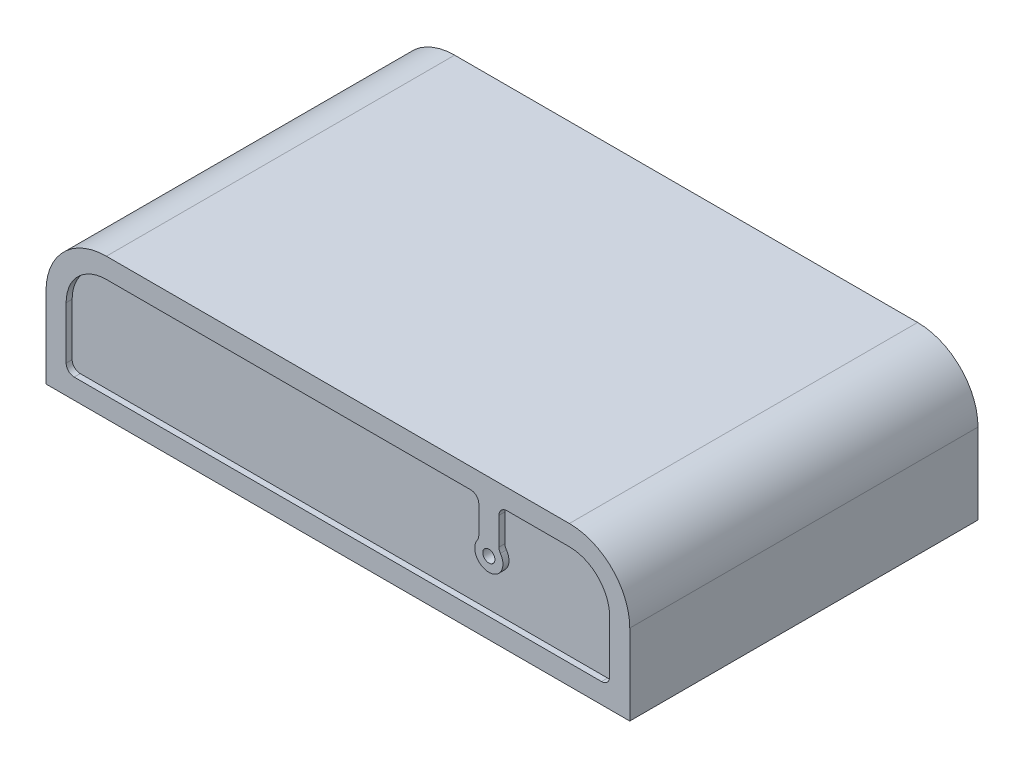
ISO-10303-21;
HEADER;
FILE_DESCRIPTION(('STEP AP214'),'2;1');
FILE_NAME('part.step','',(''),(''),'','','');
FILE_SCHEMA(('AUTOMOTIVE_DESIGN { 1 0 10303 214 1 1 1 1 }'));
ENDSEC;
DATA;
#1=APPLICATION_CONTEXT('core data for automotive mechanical design processes');
#2=APPLICATION_PROTOCOL_DEFINITION('international standard','automotive_design',2000,#1);
#3=PRODUCT_CONTEXT('',#1,'mechanical');
#4=PRODUCT('Part','Part','',(#3));
#5=PRODUCT_RELATED_PRODUCT_CATEGORY('part','',(#4));
#6=PRODUCT_DEFINITION_FORMATION('','',#4);
#7=PRODUCT_DEFINITION_CONTEXT('part definition',#1,'design');
#8=PRODUCT_DEFINITION('design','',#6,#7);
#9=PRODUCT_DEFINITION_SHAPE('','',#8);
#10=(LENGTH_UNIT() NAMED_UNIT(*) SI_UNIT(.MILLI.,.METRE.));
#11=(NAMED_UNIT(*) PLANE_ANGLE_UNIT() SI_UNIT($,.RADIAN.));
#12=(NAMED_UNIT(*) SI_UNIT($,.STERADIAN.) SOLID_ANGLE_UNIT());
#13=UNCERTAINTY_MEASURE_WITH_UNIT(LENGTH_MEASURE(1.E-05),#10,'distance_accuracy_value','');
#14=(GEOMETRIC_REPRESENTATION_CONTEXT(3) GLOBAL_UNCERTAINTY_ASSIGNED_CONTEXT((#13)) GLOBAL_UNIT_ASSIGNED_CONTEXT((#10,
#11,#12)) REPRESENTATION_CONTEXT('',''));
#15=CARTESIAN_POINT('',(0.,0.,0.));
#16=DIRECTION('',(0.,0.,1.));
#17=DIRECTION('',(1.,0.,0.));
#18=AXIS2_PLACEMENT_3D('',#15,#16,#17);
#19=CARTESIAN_POINT('',(-72.5,0.,86.5));
#20=DIRECTION('',(1.,0.,0.));
#21=DIRECTION('',(0.,1.,0.));
#22=AXIS2_PLACEMENT_3D('',#19,#20,#21);
#23=PLANE('',#22);
#24=DIRECTION('',(0.,-1.,0.));
#25=VECTOR('',#24,1.);
#26=CARTESIAN_POINT('',(-72.5,0.,0.));
#27=LINE('',#26,#25);
#28=CARTESIAN_POINT('',(-72.5,20.,0.));
#29=VERTEX_POINT('',#28);
#30=CARTESIAN_POINT('',(-72.5,0.,0.));
#31=VERTEX_POINT('',#30);
#32=EDGE_CURVE('E619',#29,#31,#27,.T.);
#33=ORIENTED_EDGE('',*,*,#32,.T.);
#34=DIRECTION('',(0.,0.,-1.));
#35=VECTOR('',#34,1.);
#36=CARTESIAN_POINT('',(-72.5,0.,86.5));
#37=LINE('',#36,#35);
#38=CARTESIAN_POINT('',(-72.5,0.,86.5));
#39=VERTEX_POINT('',#38);
#40=EDGE_CURVE('E668',#39,#31,#37,.T.);
#41=ORIENTED_EDGE('',*,*,#40,.F.);
#42=DIRECTION('',(0.,-1.,0.));
#43=VECTOR('',#42,1.);
#44=CARTESIAN_POINT('',(-72.5,0.,86.5));
#45=LINE('',#44,#43);
#46=CARTESIAN_POINT('',(-72.5,20.,86.5));
#47=VERTEX_POINT('',#46);
#48=EDGE_CURVE('E628',#47,#39,#45,.T.);
#49=ORIENTED_EDGE('',*,*,#48,.F.);
#50=DIRECTION('',(0.,0.,-1.));
#51=VECTOR('',#50,1.);
#52=CARTESIAN_POINT('',(-72.5,20.,86.5));
#53=LINE('',#52,#51);
#54=EDGE_CURVE('E642',#47,#29,#53,.T.);
#55=ORIENTED_EDGE('',*,*,#54,.T.);
#56=EDGE_LOOP('',(#33,#41,#49,#55));
#57=FACE_BOUND('',#56,.T.);
#58=ADVANCED_FACE('F37',(#57),#23,.F.);
#59=CARTESIAN_POINT('',(72.5,0.,86.5));
#60=DIRECTION('',(0.,1.,0.));
#61=DIRECTION('',(0.,0.,1.));
#62=AXIS2_PLACEMENT_3D('',#59,#60,#61);
#63=PLANE('',#62);
#64=DIRECTION('',(-1.,0.,0.));
#65=VECTOR('',#64,1.);
#66=CARTESIAN_POINT('',(-63.5,0.,79.75));
#67=LINE('',#66,#65);
#68=CARTESIAN_POINT('',(63.5,0.,79.75));
#69=VERTEX_POINT('',#68);
#70=CARTESIAN_POINT('',(-63.5,0.,79.75));
#71=VERTEX_POINT('',#70);
#72=EDGE_CURVE('E555',#69,#71,#67,.T.);
#73=ORIENTED_EDGE('',*,*,#72,.F.);
#74=CARTESIAN_POINT('',(63.5,0.,76.75));
#75=DIRECTION('',(0.,-1.,0.));
#76=DIRECTION('',(0.,0.,1.));
#77=AXIS2_PLACEMENT_3D('',#74,#75,#76);
#78=CIRCLE('',#77,3.);
#79=CARTESIAN_POINT('',(66.5,0.,76.75));
#80=VERTEX_POINT('',#79);
#81=EDGE_CURVE('E497',#80,#69,#78,.T.);
#82=ORIENTED_EDGE('',*,*,#81,.F.);
#83=DIRECTION('',(0.,0.,1.));
#84=VECTOR('',#83,1.);
#85=CARTESIAN_POINT('',(66.5,0.,76.75));
#86=LINE('',#85,#84);
#87=CARTESIAN_POINT('',(66.5,0.,9.74999999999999));
#88=VERTEX_POINT('',#87);
#89=EDGE_CURVE('E532',#88,#80,#86,.T.);
#90=ORIENTED_EDGE('',*,*,#89,.F.);
#91=CARTESIAN_POINT('',(63.5,0.,9.74999999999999));
#92=DIRECTION('',(0.,-1.,0.));
#93=DIRECTION('',(0.,0.,-1.));
#94=AXIS2_PLACEMENT_3D('',#91,#92,#93);
#95=CIRCLE('',#94,3.);
#96=CARTESIAN_POINT('',(63.5,0.,6.75));
#97=VERTEX_POINT('',#96);
#98=EDGE_CURVE('E570',#97,#88,#95,.T.);
#99=ORIENTED_EDGE('',*,*,#98,.F.);
#100=DIRECTION('',(1.,0.,0.));
#101=VECTOR('',#100,1.);
#102=CARTESIAN_POINT('',(-63.5,0.,6.75));
#103=LINE('',#102,#101);
#104=CARTESIAN_POINT('',(-63.5,0.,6.74999999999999));
#105=VERTEX_POINT('',#104);
#106=EDGE_CURVE('E567',#105,#97,#103,.T.);
#107=ORIENTED_EDGE('',*,*,#106,.F.);
#108=CARTESIAN_POINT('',(-63.5,0.,9.74999999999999));
#109=DIRECTION('',(0.,-1.,0.));
#110=DIRECTION('',(0.,0.,-1.));
#111=AXIS2_PLACEMENT_3D('',#108,#109,#110);
#112=CIRCLE('',#111,3.);
#113=CARTESIAN_POINT('',(-66.5,0.,9.74999999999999));
#114=VERTEX_POINT('',#113);
#115=EDGE_CURVE('E564',#114,#105,#112,.T.);
#116=ORIENTED_EDGE('',*,*,#115,.F.);
#117=DIRECTION('',(0.,0.,-1.));
#118=VECTOR('',#117,1.);
#119=CARTESIAN_POINT('',(-66.5,0.,76.75));
#120=LINE('',#119,#118);
#121=CARTESIAN_POINT('',(-66.5,0.,76.75));
#122=VERTEX_POINT('',#121);
#123=EDGE_CURVE('E561',#122,#114,#120,.T.);
#124=ORIENTED_EDGE('',*,*,#123,.F.);
#125=CARTESIAN_POINT('',(-63.5,0.,76.75));
#126=DIRECTION('',(0.,-1.,0.));
#127=DIRECTION('',(0.,0.,-1.));
#128=AXIS2_PLACEMENT_3D('',#125,#126,#127);
#129=CIRCLE('',#128,3.);
#130=EDGE_CURVE('E558',#71,#122,#129,.T.);
#131=ORIENTED_EDGE('',*,*,#130,.F.);
#132=EDGE_LOOP('',(#73,#82,#90,#99,#107,#116,#124,#131));
#133=FACE_BOUND('',#132,.T.);
#134=DIRECTION('',(1.,0.,0.));
#135=VECTOR('',#134,1.);
#136=CARTESIAN_POINT('',(72.5,0.,0.));
#137=LINE('',#136,#135);
#138=CARTESIAN_POINT('',(72.5,0.,0.));
#139=VERTEX_POINT('',#138);
#140=EDGE_CURVE('E645',#31,#139,#137,.T.);
#141=ORIENTED_EDGE('',*,*,#140,.T.);
#142=DIRECTION('',(0.,0.,-1.));
#143=VECTOR('',#142,1.);
#144=CARTESIAN_POINT('',(72.5,0.,86.5));
#145=LINE('',#144,#143);
#146=CARTESIAN_POINT('',(72.5,0.,86.5));
#147=VERTEX_POINT('',#146);
#148=EDGE_CURVE('E665',#147,#139,#145,.T.);
#149=ORIENTED_EDGE('',*,*,#148,.F.);
#150=DIRECTION('',(1.,0.,0.));
#151=VECTOR('',#150,1.);
#152=CARTESIAN_POINT('',(72.5,0.,86.5));
#153=LINE('',#152,#151);
#154=EDGE_CURVE('E631',#39,#147,#153,.T.);
#155=ORIENTED_EDGE('',*,*,#154,.F.);
#156=ORIENTED_EDGE('',*,*,#40,.T.);
#157=EDGE_LOOP('',(#141,#149,#155,#156));
#158=FACE_BOUND('',#157,.T.);
#159=ADVANCED_FACE('F729',(#133,#158),#63,.F.);
#160=CARTESIAN_POINT('',(72.5,20.,86.5));
#161=DIRECTION('',(-1.,0.,0.));
#162=DIRECTION('',(0.,-1.,0.));
#163=AXIS2_PLACEMENT_3D('',#160,#161,#162);
#164=PLANE('',#163);
#165=DIRECTION('',(0.,1.,0.));
#166=VECTOR('',#165,1.);
#167=CARTESIAN_POINT('',(72.5,20.,0.));
#168=LINE('',#167,#166);
#169=CARTESIAN_POINT('',(72.5,20.,0.));
#170=VERTEX_POINT('',#169);
#171=EDGE_CURVE('E647',#139,#170,#168,.T.);
#172=ORIENTED_EDGE('',*,*,#171,.T.);
#173=DIRECTION('',(0.,0.,-1.));
#174=VECTOR('',#173,1.);
#175=CARTESIAN_POINT('',(72.5,20.,86.5));
#176=LINE('',#175,#174);
#177=CARTESIAN_POINT('',(72.5,20.,86.5));
#178=VERTEX_POINT('',#177);
#179=EDGE_CURVE('E662',#178,#170,#176,.T.);
#180=ORIENTED_EDGE('',*,*,#179,.F.);
#181=DIRECTION('',(0.,1.,0.));
#182=VECTOR('',#181,1.);
#183=CARTESIAN_POINT('',(72.5,20.,86.5));
#184=LINE('',#183,#182);
#185=EDGE_CURVE('E634',#147,#178,#184,.T.);
#186=ORIENTED_EDGE('',*,*,#185,.F.);
#187=ORIENTED_EDGE('',*,*,#148,.T.);
#188=EDGE_LOOP('',(#172,#180,#186,#187));
#189=FACE_BOUND('',#188,.T.);
#190=ADVANCED_FACE('F734',(#189),#164,.F.);
#191=CARTESIAN_POINT('',(57.5,20.,86.5));
#192=DIRECTION('',(0.,0.,-1.));
#193=DIRECTION('',(-1.,0.,0.));
#194=AXIS2_PLACEMENT_3D('',#191,#192,#193);
#195=CYLINDRICAL_SURFACE('',#194,15.);
#196=CARTESIAN_POINT('',(57.5,20.,0.));
#197=DIRECTION('',(0.,0.,1.));
#198=DIRECTION('',(-1.,0.,0.));
#199=AXIS2_PLACEMENT_3D('',#196,#197,#198);
#200=CIRCLE('',#199,15.);
#201=CARTESIAN_POINT('',(57.5,35.,0.));
#202=VERTEX_POINT('',#201);
#203=EDGE_CURVE('E649',#170,#202,#200,.T.);
#204=ORIENTED_EDGE('',*,*,#203,.T.);
#205=DIRECTION('',(0.,0.,-1.));
#206=VECTOR('',#205,1.);
#207=CARTESIAN_POINT('',(57.5,35.,86.5));
#208=LINE('',#207,#206);
#209=CARTESIAN_POINT('',(57.5,35.,86.5));
#210=VERTEX_POINT('',#209);
#211=EDGE_CURVE('E659',#210,#202,#208,.T.);
#212=ORIENTED_EDGE('',*,*,#211,.F.);
#213=CARTESIAN_POINT('',(57.5,20.,86.5));
#214=DIRECTION('',(0.,0.,1.));
#215=DIRECTION('',(-1.,0.,0.));
#216=AXIS2_PLACEMENT_3D('',#213,#214,#215);
#217=CIRCLE('',#216,15.);
#218=EDGE_CURVE('E636',#178,#210,#217,.T.);
#219=ORIENTED_EDGE('',*,*,#218,.F.);
#220=ORIENTED_EDGE('',*,*,#179,.T.);
#221=EDGE_LOOP('',(#204,#212,#219,#220));
#222=FACE_BOUND('',#221,.T.);
#223=ADVANCED_FACE('F740',(#222),#195,.T.);
#224=CARTESIAN_POINT('',(-57.5,35.,86.5));
#225=DIRECTION('',(0.,-1.,0.));
#226=DIRECTION('',(1.,0.,0.));
#227=AXIS2_PLACEMENT_3D('',#224,#225,#226);
#228=PLANE('',#227);
#229=DIRECTION('',(-1.,0.,0.));
#230=VECTOR('',#229,1.);
#231=CARTESIAN_POINT('',(-57.5,35.,0.));
#232=LINE('',#231,#230);
#233=CARTESIAN_POINT('',(-57.5,35.,0.));
#234=VERTEX_POINT('',#233);
#235=EDGE_CURVE('E651',#202,#234,#232,.T.);
#236=ORIENTED_EDGE('',*,*,#235,.T.);
#237=DIRECTION('',(0.,0.,-1.));
#238=VECTOR('',#237,1.);
#239=CARTESIAN_POINT('',(-57.5,35.,86.5));
#240=LINE('',#239,#238);
#241=CARTESIAN_POINT('',(-57.5,35.,86.5));
#242=VERTEX_POINT('',#241);
#243=EDGE_CURVE('E656',#242,#234,#240,.T.);
#244=ORIENTED_EDGE('',*,*,#243,.F.);
#245=DIRECTION('',(-1.,0.,0.));
#246=VECTOR('',#245,1.);
#247=CARTESIAN_POINT('',(-57.5,35.,86.5));
#248=LINE('',#247,#246);
#249=EDGE_CURVE('E638',#210,#242,#248,.T.);
#250=ORIENTED_EDGE('',*,*,#249,.F.);
#251=ORIENTED_EDGE('',*,*,#211,.T.);
#252=EDGE_LOOP('',(#236,#244,#250,#251));
#253=FACE_BOUND('',#252,.T.);
#254=ADVANCED_FACE('F744',(#253),#228,.F.);
#255=CARTESIAN_POINT('',(-57.5,20.,86.5));
#256=DIRECTION('',(0.,0.,-1.));
#257=DIRECTION('',(-1.,0.,0.));
#258=AXIS2_PLACEMENT_3D('',#255,#256,#257);
#259=CYLINDRICAL_SURFACE('',#258,15.);
#260=CARTESIAN_POINT('',(-57.5,20.,0.));
#261=DIRECTION('',(0.,0.,1.));
#262=DIRECTION('',(-1.,0.,0.));
#263=AXIS2_PLACEMENT_3D('',#260,#261,#262);
#264=CIRCLE('',#263,15.);
#265=EDGE_CURVE('E632',#234,#29,#264,.T.);
#266=ORIENTED_EDGE('',*,*,#265,.T.);
#267=ORIENTED_EDGE('',*,*,#54,.F.);
#268=CARTESIAN_POINT('',(-57.5,20.,86.5));
#269=DIRECTION('',(0.,0.,1.));
#270=DIRECTION('',(-1.,0.,0.));
#271=AXIS2_PLACEMENT_3D('',#268,#269,#270);
#272=CIRCLE('',#271,15.);
#273=EDGE_CURVE('E640',#242,#47,#272,.T.);
#274=ORIENTED_EDGE('',*,*,#273,.F.);
#275=ORIENTED_EDGE('',*,*,#243,.T.);
#276=EDGE_LOOP('',(#266,#267,#274,#275));
#277=FACE_BOUND('',#276,.T.);
#278=ADVANCED_FACE('F748',(#277),#259,.T.);
#279=CARTESIAN_POINT('',(-57.5,20.,86.5));
#280=DIRECTION('',(0.,0.,-1.));
#281=DIRECTION('',(-1.,0.,0.));
#282=AXIS2_PLACEMENT_3D('',#279,#280,#281);
#283=PLANE('',#282);
#284=CARTESIAN_POINT('',(37.5,18.,86.5));
#285=DIRECTION('',(0.,0.,1.));
#286=DIRECTION('',(1.,0.,0.));
#287=AXIS2_PLACEMENT_3D('',#284,#285,#286);
#288=CIRCLE('',#287,1.5);
#289=CARTESIAN_POINT('',(39.,18.,86.5));
#290=VERTEX_POINT('',#289);
#291=EDGE_CURVE('E394',#290,#290,#288,.T.);
#292=ORIENTED_EDGE('',*,*,#291,.F.);
#293=EDGE_LOOP('',(#292));
#294=FACE_BOUND('',#293,.T.);
#295=DIRECTION('',(0.,-1.,0.));
#296=VECTOR('',#295,1.);
#297=CARTESIAN_POINT('',(-67.5,20.,86.5));
#298=LINE('',#297,#296);
#299=CARTESIAN_POINT('',(-67.5,20.,86.5));
#300=VERTEX_POINT('',#299);
#301=CARTESIAN_POINT('',(-67.5,7.00000000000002,86.5));
#302=VERTEX_POINT('',#301);
#303=EDGE_CURVE('E451',#300,#302,#298,.T.);
#304=ORIENTED_EDGE('',*,*,#303,.F.);
#305=CARTESIAN_POINT('',(-57.5,20.,86.5));
#306=DIRECTION('',(0.,0.,1.));
#307=DIRECTION('',(1.,0.,0.));
#308=AXIS2_PLACEMENT_3D('',#305,#306,#307);
#309=CIRCLE('',#308,9.99999999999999);
#310=CARTESIAN_POINT('',(-57.5,30.,86.5));
#311=VERTEX_POINT('',#310);
#312=EDGE_CURVE('E399',#311,#300,#309,.T.);
#313=ORIENTED_EDGE('',*,*,#312,.F.);
#314=DIRECTION('',(-1.,0.,0.));
#315=VECTOR('',#314,1.);
#316=CARTESIAN_POINT('',(33.,30.,86.5));
#317=LINE('',#316,#315);
#318=CARTESIAN_POINT('',(33.,30.,86.5));
#319=VERTEX_POINT('',#318);
#320=EDGE_CURVE('E404',#319,#311,#317,.T.);
#321=ORIENTED_EDGE('',*,*,#320,.F.);
#322=CARTESIAN_POINT('',(33.,28.,86.5));
#323=DIRECTION('',(0.,0.,1.));
#324=DIRECTION('',(1.,0.,0.));
#325=AXIS2_PLACEMENT_3D('',#322,#323,#324);
#326=CIRCLE('',#325,2.);
#327=CARTESIAN_POINT('',(35.,28.,86.5));
#328=VERTEX_POINT('',#327);
#329=EDGE_CURVE('E490',#328,#319,#326,.T.);
#330=ORIENTED_EDGE('',*,*,#329,.F.);
#331=DIRECTION('',(0.,1.,0.));
#332=VECTOR('',#331,1.);
#333=CARTESIAN_POINT('',(35.,28.,86.5));
#334=LINE('',#333,#332);
#335=CARTESIAN_POINT('',(35.,21.1622776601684,86.5));
#336=VERTEX_POINT('',#335);
#337=EDGE_CURVE('E487',#336,#328,#334,.T.);
#338=ORIENTED_EDGE('',*,*,#337,.F.);
#339=CARTESIAN_POINT('',(33.,21.1622776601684,86.5));
#340=DIRECTION('',(0.,0.,1.));
#341=DIRECTION('',(1.,0.,0.));
#342=AXIS2_PLACEMENT_3D('',#339,#340,#341);
#343=CIRCLE('',#342,2.);
#344=CARTESIAN_POINT('',(34.6363636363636,20.0123585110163,86.5));
#345=VERTEX_POINT('',#344);
#346=EDGE_CURVE('E484',#345,#336,#343,.T.);
#347=ORIENTED_EDGE('',*,*,#346,.F.);
#348=CARTESIAN_POINT('',(37.5,18.,86.5));
#349=DIRECTION('',(0.,0.,-1.));
#350=DIRECTION('',(1.,0.,0.));
#351=AXIS2_PLACEMENT_3D('',#348,#349,#350);
#352=CIRCLE('',#351,3.50000000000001);
#353=CARTESIAN_POINT('',(40.3636363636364,20.0123585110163,86.5));
#354=VERTEX_POINT('',#353);
#355=EDGE_CURVE('E481',#354,#345,#352,.T.);
#356=ORIENTED_EDGE('',*,*,#355,.F.);
#357=CARTESIAN_POINT('',(42.,21.1622776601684,86.5));
#358=DIRECTION('',(0.,0.,1.));
#359=DIRECTION('',(1.,0.,0.));
#360=AXIS2_PLACEMENT_3D('',#357,#358,#359);
#361=CIRCLE('',#360,2.);
#362=CARTESIAN_POINT('',(40.,21.1622776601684,86.5));
#363=VERTEX_POINT('',#362);
#364=EDGE_CURVE('E478',#363,#354,#361,.T.);
#365=ORIENTED_EDGE('',*,*,#364,.F.);
#366=DIRECTION('',(0.,-1.,0.));
#367=VECTOR('',#366,1.);
#368=CARTESIAN_POINT('',(40.,28.,86.5));
#369=LINE('',#368,#367);
#370=CARTESIAN_POINT('',(40.,28.,86.5));
#371=VERTEX_POINT('',#370);
#372=EDGE_CURVE('E475',#371,#363,#369,.T.);
#373=ORIENTED_EDGE('',*,*,#372,.F.);
#374=CARTESIAN_POINT('',(42.,28.,86.5));
#375=DIRECTION('',(0.,0.,1.));
#376=DIRECTION('',(-1.,0.,0.));
#377=AXIS2_PLACEMENT_3D('',#374,#375,#376);
#378=CIRCLE('',#377,2.00000000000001);
#379=CARTESIAN_POINT('',(42.,30.,86.5));
#380=VERTEX_POINT('',#379);
#381=EDGE_CURVE('E472',#380,#371,#378,.T.);
#382=ORIENTED_EDGE('',*,*,#381,.F.);
#383=DIRECTION('',(-1.,0.,0.));
#384=VECTOR('',#383,1.);
#385=CARTESIAN_POINT('',(57.5,30.,86.5));
#386=LINE('',#385,#384);
#387=CARTESIAN_POINT('',(57.5,30.,86.5));
#388=VERTEX_POINT('',#387);
#389=EDGE_CURVE('E469',#388,#380,#386,.T.);
#390=ORIENTED_EDGE('',*,*,#389,.F.);
#391=CARTESIAN_POINT('',(57.5,20.,86.5));
#392=DIRECTION('',(0.,0.,1.));
#393=DIRECTION('',(1.,0.,0.));
#394=AXIS2_PLACEMENT_3D('',#391,#392,#393);
#395=CIRCLE('',#394,10.);
#396=CARTESIAN_POINT('',(67.5,20.,86.5));
#397=VERTEX_POINT('',#396);
#398=EDGE_CURVE('E466',#397,#388,#395,.T.);
#399=ORIENTED_EDGE('',*,*,#398,.F.);
#400=DIRECTION('',(0.,1.,0.));
#401=VECTOR('',#400,1.);
#402=CARTESIAN_POINT('',(67.5,7.00000000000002,86.5));
#403=LINE('',#402,#401);
#404=CARTESIAN_POINT('',(67.5,7.,86.5));
#405=VERTEX_POINT('',#404);
#406=EDGE_CURVE('E463',#405,#397,#403,.T.);
#407=ORIENTED_EDGE('',*,*,#406,.F.);
#408=CARTESIAN_POINT('',(65.5,7.,86.5));
#409=DIRECTION('',(0.,0.,1.));
#410=DIRECTION('',(1.,0.,0.));
#411=AXIS2_PLACEMENT_3D('',#408,#409,#410);
#412=CIRCLE('',#411,2.);
#413=CARTESIAN_POINT('',(65.5,5.,86.5));
#414=VERTEX_POINT('',#413);
#415=EDGE_CURVE('E460',#414,#405,#412,.T.);
#416=ORIENTED_EDGE('',*,*,#415,.F.);
#417=DIRECTION('',(1.,0.,0.));
#418=VECTOR('',#417,1.);
#419=CARTESIAN_POINT('',(-65.5,5.,86.5));
#420=LINE('',#419,#418);
#421=CARTESIAN_POINT('',(-65.5,5.,86.5));
#422=VERTEX_POINT('',#421);
#423=EDGE_CURVE('E457',#422,#414,#420,.T.);
#424=ORIENTED_EDGE('',*,*,#423,.F.);
#425=CARTESIAN_POINT('',(-65.5,7.,86.5));
#426=DIRECTION('',(0.,0.,1.));
#427=DIRECTION('',(1.,0.,0.));
#428=AXIS2_PLACEMENT_3D('',#425,#426,#427);
#429=CIRCLE('',#428,2.);
#430=EDGE_CURVE('E454',#302,#422,#429,.T.);
#431=ORIENTED_EDGE('',*,*,#430,.F.);
#432=EDGE_LOOP('',(#304,#313,#321,#330,#338,#347,#356,#365,#373,#382,#390,#399,#407,#416,#424,#431));
#433=FACE_BOUND('',#432,.T.);
#434=ORIENTED_EDGE('',*,*,#48,.T.);
#435=ORIENTED_EDGE('',*,*,#154,.T.);
#436=ORIENTED_EDGE('',*,*,#185,.T.);
#437=ORIENTED_EDGE('',*,*,#218,.T.);
#438=ORIENTED_EDGE('',*,*,#249,.T.);
#439=ORIENTED_EDGE('',*,*,#273,.T.);
#440=EDGE_LOOP('',(#434,#435,#436,#437,#438,#439));
#441=FACE_BOUND('',#440,.T.);
#442=ADVANCED_FACE('F752',(#294,#433,#441),#283,.F.);
#443=CARTESIAN_POINT('',(-57.5,20.,0.));
#444=DIRECTION('',(0.,0.,-1.));
#445=DIRECTION('',(-1.,0.,0.));
#446=AXIS2_PLACEMENT_3D('',#443,#444,#445);
#447=PLANE('',#446);
#448=CARTESIAN_POINT('',(-50.5,17.5,0.));
#449=DIRECTION('',(0.,0.,-1.));
#450=DIRECTION('',(-1.,0.,0.));
#451=AXIS2_PLACEMENT_3D('',#448,#449,#450);
#452=CIRCLE('',#451,6.5);
#453=CARTESIAN_POINT('',(-45.8095842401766,13.,0.));
#454=VERTEX_POINT('',#453);
#455=CARTESIAN_POINT('',(-55.1904157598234,13.,0.));
#456=VERTEX_POINT('',#455);
#457=EDGE_CURVE('E692',#454,#456,#452,.F.);
#458=ORIENTED_EDGE('',*,*,#457,.T.);
#459=CARTESIAN_POINT('',(-50.5,8.50000000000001,0.));
#460=DIRECTION('',(0.,0.,-1.));
#461=DIRECTION('',(-1.,0.,0.));
#462=AXIS2_PLACEMENT_3D('',#459,#460,#461);
#463=CIRCLE('',#462,6.5);
#464=EDGE_CURVE('E694',#456,#454,#463,.F.);
#465=ORIENTED_EDGE('',*,*,#464,.T.);
#466=EDGE_LOOP('',(#458,#465));
#467=FACE_BOUND('',#466,.T.);
#468=CARTESIAN_POINT('',(38.5,17.5,0.));
#469=DIRECTION('',(0.,0.,-1.));
#470=DIRECTION('',(-1.,0.,0.));
#471=AXIS2_PLACEMENT_3D('',#468,#469,#470);
#472=CIRCLE('',#471,6.5);
#473=CARTESIAN_POINT('',(32.,17.5,0.));
#474=VERTEX_POINT('',#473);
#475=EDGE_CURVE('E689',#474,#474,#472,.F.);
#476=ORIENTED_EDGE('',*,*,#475,.T.);
#477=EDGE_LOOP('',(#476));
#478=FACE_BOUND('',#477,.T.);
#479=CARTESIAN_POINT('',(12.5,13.,0.));
#480=DIRECTION('',(0.,0.,-1.));
#481=DIRECTION('',(-1.,0.,0.));
#482=AXIS2_PLACEMENT_3D('',#479,#480,#481);
#483=CIRCLE('',#482,4.);
#484=CARTESIAN_POINT('',(8.49999999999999,13.,0.));
#485=VERTEX_POINT('',#484);
#486=EDGE_CURVE('E348',#485,#485,#483,.T.);
#487=ORIENTED_EDGE('',*,*,#486,.F.);
#488=EDGE_LOOP('',(#487));
#489=FACE_BOUND('',#488,.T.);
#490=CARTESIAN_POINT('',(-6.5,13.,0.));
#491=DIRECTION('',(0.,0.,-1.));
#492=DIRECTION('',(-1.,0.,0.));
#493=AXIS2_PLACEMENT_3D('',#490,#491,#492);
#494=CIRCLE('',#493,4.);
#495=CARTESIAN_POINT('',(-10.5,13.,0.));
#496=VERTEX_POINT('',#495);
#497=EDGE_CURVE('E352',#496,#496,#494,.T.);
#498=ORIENTED_EDGE('',*,*,#497,.F.);
#499=EDGE_LOOP('',(#498));
#500=FACE_BOUND('',#499,.T.);
#501=ORIENTED_EDGE('',*,*,#32,.F.);
#502=ORIENTED_EDGE('',*,*,#265,.F.);
#503=ORIENTED_EDGE('',*,*,#235,.F.);
#504=ORIENTED_EDGE('',*,*,#203,.F.);
#505=ORIENTED_EDGE('',*,*,#171,.F.);
#506=ORIENTED_EDGE('',*,*,#140,.F.);
#507=EDGE_LOOP('',(#501,#502,#503,#504,#505,#506));
#508=FACE_BOUND('',#507,.T.);
#509=ADVANCED_FACE('F754',(#467,#478,#489,#500,#508),#447,.T.);
#510=CARTESIAN_POINT('',(63.5,2.5,76.75));
#511=DIRECTION('',(0.,1.,0.));
#512=DIRECTION('',(0.,0.,1.));
#513=AXIS2_PLACEMENT_3D('',#510,#511,#512);
#514=PLANE('',#513);
#515=CARTESIAN_POINT('',(-62.5,2.5,10.75));
#516=DIRECTION('',(0.,-1.,0.));
#517=DIRECTION('',(0.,0.,-1.));
#518=AXIS2_PLACEMENT_3D('',#515,#516,#517);
#519=CIRCLE('',#518,2.);
#520=CARTESIAN_POINT('',(-62.5,2.5,8.75));
#521=VERTEX_POINT('',#520);
#522=EDGE_CURVE('E372',#521,#521,#519,.T.);
#523=ORIENTED_EDGE('',*,*,#522,.F.);
#524=EDGE_LOOP('',(#523));
#525=FACE_BOUND('',#524,.T.);
#526=CARTESIAN_POINT('',(62.5,2.5,10.75));
#527=DIRECTION('',(0.,-1.,0.));
#528=DIRECTION('',(0.,0.,-1.));
#529=AXIS2_PLACEMENT_3D('',#526,#527,#528);
#530=CIRCLE('',#529,2.);
#531=CARTESIAN_POINT('',(62.5,2.5,8.75000000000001));
#532=VERTEX_POINT('',#531);
#533=EDGE_CURVE('E383',#532,#532,#530,.T.);
#534=ORIENTED_EDGE('',*,*,#533,.F.);
#535=EDGE_LOOP('',(#534));
#536=FACE_BOUND('',#535,.T.);
#537=CARTESIAN_POINT('',(62.5,2.5,75.75));
#538=DIRECTION('',(0.,-1.,0.));
#539=DIRECTION('',(0.,0.,-1.));
#540=AXIS2_PLACEMENT_3D('',#537,#538,#539);
#541=CIRCLE('',#540,2.);
#542=CARTESIAN_POINT('',(62.5,2.5,73.75));
#543=VERTEX_POINT('',#542);
#544=EDGE_CURVE('E377',#543,#543,#541,.T.);
#545=ORIENTED_EDGE('',*,*,#544,.F.);
#546=EDGE_LOOP('',(#545));
#547=FACE_BOUND('',#546,.T.);
#548=CARTESIAN_POINT('',(-62.5,2.5,75.75));
#549=DIRECTION('',(0.,-1.,0.));
#550=DIRECTION('',(0.,0.,-1.));
#551=AXIS2_PLACEMENT_3D('',#548,#549,#550);
#552=CIRCLE('',#551,2.);
#553=CARTESIAN_POINT('',(-62.5,2.5,73.75));
#554=VERTEX_POINT('',#553);
#555=EDGE_CURVE('E376',#554,#554,#552,.T.);
#556=ORIENTED_EDGE('',*,*,#555,.F.);
#557=EDGE_LOOP('',(#556));
#558=FACE_BOUND('',#557,.T.);
#559=CARTESIAN_POINT('',(63.5,2.5,76.75));
#560=DIRECTION('',(0.,-1.,0.));
#561=DIRECTION('',(0.,0.,1.));
#562=AXIS2_PLACEMENT_3D('',#559,#560,#561);
#563=CIRCLE('',#562,3.);
#564=CARTESIAN_POINT('',(66.5,2.5,76.75));
#565=VERTEX_POINT('',#564);
#566=CARTESIAN_POINT('',(63.5,2.5,79.75));
#567=VERTEX_POINT('',#566);
#568=EDGE_CURVE('E528',#565,#567,#563,.T.);
#569=ORIENTED_EDGE('',*,*,#568,.T.);
#570=DIRECTION('',(-1.,0.,0.));
#571=VECTOR('',#570,1.);
#572=CARTESIAN_POINT('',(-63.5,2.5,79.75));
#573=LINE('',#572,#571);
#574=CARTESIAN_POINT('',(-63.5,2.5,79.75));
#575=VERTEX_POINT('',#574);
#576=EDGE_CURVE('E531',#567,#575,#573,.T.);
#577=ORIENTED_EDGE('',*,*,#576,.T.);
#578=CARTESIAN_POINT('',(-63.5,2.5,76.75));
#579=DIRECTION('',(0.,-1.,0.));
#580=DIRECTION('',(0.,0.,-1.));
#581=AXIS2_PLACEMENT_3D('',#578,#579,#580);
#582=CIRCLE('',#581,3.);
#583=CARTESIAN_POINT('',(-66.5,2.5,76.75));
#584=VERTEX_POINT('',#583);
#585=EDGE_CURVE('E535',#575,#584,#582,.T.);
#586=ORIENTED_EDGE('',*,*,#585,.T.);
#587=DIRECTION('',(0.,0.,-1.));
#588=VECTOR('',#587,1.);
#589=CARTESIAN_POINT('',(-66.5,2.5,76.75));
#590=LINE('',#589,#588);
#591=CARTESIAN_POINT('',(-66.5,2.5,9.74999999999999));
#592=VERTEX_POINT('',#591);
#593=EDGE_CURVE('E538',#584,#592,#590,.T.);
#594=ORIENTED_EDGE('',*,*,#593,.T.);
#595=CARTESIAN_POINT('',(-63.5,2.5,9.74999999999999));
#596=DIRECTION('',(0.,-1.,0.));
#597=DIRECTION('',(0.,0.,-1.));
#598=AXIS2_PLACEMENT_3D('',#595,#596,#597);
#599=CIRCLE('',#598,3.);
#600=CARTESIAN_POINT('',(-63.5,2.5,6.74999999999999));
#601=VERTEX_POINT('',#600);
#602=EDGE_CURVE('E541',#592,#601,#599,.T.);
#603=ORIENTED_EDGE('',*,*,#602,.T.);
#604=DIRECTION('',(1.,0.,0.));
#605=VECTOR('',#604,1.);
#606=CARTESIAN_POINT('',(-63.5,2.5,6.75));
#607=LINE('',#606,#605);
#608=CARTESIAN_POINT('',(63.5,2.5,6.75));
#609=VERTEX_POINT('',#608);
#610=EDGE_CURVE('E544',#601,#609,#607,.T.);
#611=ORIENTED_EDGE('',*,*,#610,.T.);
#612=CARTESIAN_POINT('',(63.5,2.5,9.74999999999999));
#613=DIRECTION('',(0.,-1.,0.));
#614=DIRECTION('',(0.,0.,-1.));
#615=AXIS2_PLACEMENT_3D('',#612,#613,#614);
#616=CIRCLE('',#615,3.);
#617=CARTESIAN_POINT('',(66.5,2.5,9.74999999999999));
#618=VERTEX_POINT('',#617);
#619=EDGE_CURVE('E547',#609,#618,#616,.T.);
#620=ORIENTED_EDGE('',*,*,#619,.T.);
#621=DIRECTION('',(0.,0.,1.));
#622=VECTOR('',#621,1.);
#623=CARTESIAN_POINT('',(66.5,2.5,76.75));
#624=LINE('',#623,#622);
#625=EDGE_CURVE('E550',#618,#565,#624,.T.);
#626=ORIENTED_EDGE('',*,*,#625,.T.);
#627=EDGE_LOOP('',(#569,#577,#586,#594,#603,#611,#620,#626));
#628=FACE_BOUND('',#627,.T.);
#629=DIRECTION('',(0.,0.,-1.));
#630=VECTOR('',#629,1.);
#631=CARTESIAN_POINT('',(-60.5,2.5,74.75));
#632=LINE('',#631,#630);
#633=CARTESIAN_POINT('',(-60.5,2.5,74.75));
#634=VERTEX_POINT('',#633);
#635=CARTESIAN_POINT('',(-60.5,2.5,11.75));
#636=VERTEX_POINT('',#635);
#637=EDGE_CURVE('E594',#634,#636,#632,.T.);
#638=ORIENTED_EDGE('',*,*,#637,.F.);
#639=DIRECTION('',(-1.,0.,0.));
#640=VECTOR('',#639,1.);
#641=CARTESIAN_POINT('',(-60.5,2.5,74.75));
#642=LINE('',#641,#640);
#643=CARTESIAN_POINT('',(60.5,2.5,74.75));
#644=VERTEX_POINT('',#643);
#645=EDGE_CURVE('E577',#644,#634,#642,.T.);
#646=ORIENTED_EDGE('',*,*,#645,.F.);
#647=DIRECTION('',(0.,0.,1.));
#648=VECTOR('',#647,1.);
#649=CARTESIAN_POINT('',(60.5,2.5,74.75));
#650=LINE('',#649,#648);
#651=CARTESIAN_POINT('',(60.5,2.5,11.75));
#652=VERTEX_POINT('',#651);
#653=EDGE_CURVE('E671',#652,#644,#650,.T.);
#654=ORIENTED_EDGE('',*,*,#653,.F.);
#655=DIRECTION('',(1.,0.,0.));
#656=VECTOR('',#655,1.);
#657=CARTESIAN_POINT('',(-60.5,2.5,11.75));
#658=LINE('',#657,#656);
#659=EDGE_CURVE('E597',#636,#652,#658,.T.);
#660=ORIENTED_EDGE('',*,*,#659,.F.);
#661=EDGE_LOOP('',(#638,#646,#654,#660));
#662=FACE_BOUND('',#661,.T.);
#663=ADVANCED_FACE('F757',(#525,#536,#547,#558,#628,#662),#514,.F.);
#664=CARTESIAN_POINT('',(63.5,2.5,76.75));
#665=DIRECTION('',(0.,-1.,0.));
#666=DIRECTION('',(0.,0.,-1.));
#667=AXIS2_PLACEMENT_3D('',#664,#665,#666);
#668=CYLINDRICAL_SURFACE('',#667,3.);
#669=ORIENTED_EDGE('',*,*,#81,.T.);
#670=DIRECTION('',(0.,-1.,0.));
#671=VECTOR('',#670,1.);
#672=CARTESIAN_POINT('',(63.5,2.5,79.75));
#673=LINE('',#672,#671);
#674=EDGE_CURVE('E553',#567,#69,#673,.T.);
#675=ORIENTED_EDGE('',*,*,#674,.F.);
#676=ORIENTED_EDGE('',*,*,#568,.F.);
#677=DIRECTION('',(0.,-1.,0.));
#678=VECTOR('',#677,1.);
#679=CARTESIAN_POINT('',(66.5,2.5,76.75));
#680=LINE('',#679,#678);
#681=EDGE_CURVE('E575',#565,#80,#680,.T.);
#682=ORIENTED_EDGE('',*,*,#681,.T.);
#683=EDGE_LOOP('',(#669,#675,#676,#682));
#684=FACE_BOUND('',#683,.T.);
#685=ADVANCED_FACE('F782',(#684),#668,.F.);
#686=CARTESIAN_POINT('',(66.5,2.5,76.75));
#687=DIRECTION('',(1.,0.,0.));
#688=DIRECTION('',(0.,0.,-1.));
#689=AXIS2_PLACEMENT_3D('',#686,#687,#688);
#690=PLANE('',#689);
#691=ORIENTED_EDGE('',*,*,#89,.T.);
#692=ORIENTED_EDGE('',*,*,#681,.F.);
#693=ORIENTED_EDGE('',*,*,#625,.F.);
#694=DIRECTION('',(0.,-1.,0.));
#695=VECTOR('',#694,1.);
#696=CARTESIAN_POINT('',(66.5,2.5,9.74999999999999));
#697=LINE('',#696,#695);
#698=EDGE_CURVE('E578',#618,#88,#697,.T.);
#699=ORIENTED_EDGE('',*,*,#698,.T.);
#700=EDGE_LOOP('',(#691,#692,#693,#699));
#701=FACE_BOUND('',#700,.T.);
#702=ADVANCED_FACE('F785',(#701),#690,.F.);
#703=CARTESIAN_POINT('',(63.5,2.5,9.74999999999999));
#704=DIRECTION('',(0.,-1.,0.));
#705=DIRECTION('',(0.,0.,-1.));
#706=AXIS2_PLACEMENT_3D('',#703,#704,#705);
#707=CYLINDRICAL_SURFACE('',#706,3.);
#708=ORIENTED_EDGE('',*,*,#98,.T.);
#709=ORIENTED_EDGE('',*,*,#698,.F.);
#710=ORIENTED_EDGE('',*,*,#619,.F.);
#711=DIRECTION('',(0.,-1.,0.));
#712=VECTOR('',#711,1.);
#713=CARTESIAN_POINT('',(63.5,2.5,6.75));
#714=LINE('',#713,#712);
#715=EDGE_CURVE('E580',#609,#97,#714,.T.);
#716=ORIENTED_EDGE('',*,*,#715,.T.);
#717=EDGE_LOOP('',(#708,#709,#710,#716));
#718=FACE_BOUND('',#717,.T.);
#719=ADVANCED_FACE('F805',(#718),#707,.F.);
#720=CARTESIAN_POINT('',(-63.5,2.5,6.75));
#721=DIRECTION('',(0.,0.,-1.));
#722=DIRECTION('',(-1.,0.,0.));
#723=AXIS2_PLACEMENT_3D('',#720,#721,#722);
#724=PLANE('',#723);
#725=ORIENTED_EDGE('',*,*,#106,.T.);
#726=ORIENTED_EDGE('',*,*,#715,.F.);
#727=ORIENTED_EDGE('',*,*,#610,.F.);
#728=DIRECTION('',(0.,-1.,0.));
#729=VECTOR('',#728,1.);
#730=CARTESIAN_POINT('',(-63.5,2.5,6.74999999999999));
#731=LINE('',#730,#729);
#732=EDGE_CURVE('E582',#601,#105,#731,.T.);
#733=ORIENTED_EDGE('',*,*,#732,.T.);
#734=EDGE_LOOP('',(#725,#726,#727,#733));
#735=FACE_BOUND('',#734,.T.);
#736=ADVANCED_FACE('F801',(#735),#724,.F.);
#737=CARTESIAN_POINT('',(-63.5,2.5,9.74999999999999));
#738=DIRECTION('',(0.,-1.,0.));
#739=DIRECTION('',(0.,0.,-1.));
#740=AXIS2_PLACEMENT_3D('',#737,#738,#739);
#741=CYLINDRICAL_SURFACE('',#740,3.);
#742=ORIENTED_EDGE('',*,*,#115,.T.);
#743=ORIENTED_EDGE('',*,*,#732,.F.);
#744=ORIENTED_EDGE('',*,*,#602,.F.);
#745=DIRECTION('',(0.,-1.,0.));
#746=VECTOR('',#745,1.);
#747=CARTESIAN_POINT('',(-66.5,2.5,9.74999999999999));
#748=LINE('',#747,#746);
#749=EDGE_CURVE('E584',#592,#114,#748,.T.);
#750=ORIENTED_EDGE('',*,*,#749,.T.);
#751=EDGE_LOOP('',(#742,#743,#744,#750));
#752=FACE_BOUND('',#751,.T.);
#753=ADVANCED_FACE('F797',(#752),#741,.F.);
#754=CARTESIAN_POINT('',(-66.5,2.5,76.75));
#755=DIRECTION('',(-1.,0.,0.));
#756=DIRECTION('',(0.,0.,1.));
#757=AXIS2_PLACEMENT_3D('',#754,#755,#756);
#758=PLANE('',#757);
#759=ORIENTED_EDGE('',*,*,#123,.T.);
#760=ORIENTED_EDGE('',*,*,#749,.F.);
#761=ORIENTED_EDGE('',*,*,#593,.F.);
#762=DIRECTION('',(0.,-1.,0.));
#763=VECTOR('',#762,1.);
#764=CARTESIAN_POINT('',(-66.5,2.5,76.75));
#765=LINE('',#764,#763);
#766=EDGE_CURVE('E586',#584,#122,#765,.T.);
#767=ORIENTED_EDGE('',*,*,#766,.T.);
#768=EDGE_LOOP('',(#759,#760,#761,#767));
#769=FACE_BOUND('',#768,.T.);
#770=ADVANCED_FACE('F793',(#769),#758,.F.);
#771=CARTESIAN_POINT('',(-63.5,2.5,76.75));
#772=DIRECTION('',(0.,-1.,0.));
#773=DIRECTION('',(0.,0.,-1.));
#774=AXIS2_PLACEMENT_3D('',#771,#772,#773);
#775=CYLINDRICAL_SURFACE('',#774,3.);
#776=ORIENTED_EDGE('',*,*,#130,.T.);
#777=ORIENTED_EDGE('',*,*,#766,.F.);
#778=ORIENTED_EDGE('',*,*,#585,.F.);
#779=DIRECTION('',(0.,-1.,0.));
#780=VECTOR('',#779,1.);
#781=CARTESIAN_POINT('',(-63.5,2.5,79.75));
#782=LINE('',#781,#780);
#783=EDGE_CURVE('E588',#575,#71,#782,.T.);
#784=ORIENTED_EDGE('',*,*,#783,.T.);
#785=EDGE_LOOP('',(#776,#777,#778,#784));
#786=FACE_BOUND('',#785,.T.);
#787=ADVANCED_FACE('F789',(#786),#775,.F.);
#788=CARTESIAN_POINT('',(-63.5,2.5,79.75));
#789=DIRECTION('',(0.,0.,1.));
#790=DIRECTION('',(1.,0.,0.));
#791=AXIS2_PLACEMENT_3D('',#788,#789,#790);
#792=PLANE('',#791);
#793=ORIENTED_EDGE('',*,*,#72,.T.);
#794=ORIENTED_EDGE('',*,*,#783,.F.);
#795=ORIENTED_EDGE('',*,*,#576,.F.);
#796=ORIENTED_EDGE('',*,*,#674,.T.);
#797=EDGE_LOOP('',(#793,#794,#795,#796));
#798=FACE_BOUND('',#797,.T.);
#799=ADVANCED_FACE('F781',(#798),#792,.F.);
#800=CARTESIAN_POINT('',(0.,20.,0.));
#801=DIRECTION('',(0.,1.,0.));
#802=DIRECTION('',(0.,0.,1.));
#803=AXIS2_PLACEMENT_3D('',#800,#801,#802);
#804=PLANE('',#803);
#805=DIRECTION('',(-1.,0.,0.));
#806=VECTOR('',#805,1.);
#807=CARTESIAN_POINT('',(0.,20.,31.75));
#808=LINE('',#807,#806);
#809=CARTESIAN_POINT('',(15.1925824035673,20.,31.75));
#810=VERTEX_POINT('',#809);
#811=CARTESIAN_POINT('',(9.80741759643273,20.,31.75));
#812=VERTEX_POINT('',#811);
#813=EDGE_CURVE('E11',#810,#812,#808,.T.);
#814=ORIENTED_EDGE('',*,*,#813,.F.);
#815=DIRECTION('',(0.,0.,-1.));
#816=VECTOR('',#815,1.);
#817=CARTESIAN_POINT('',(15.1925824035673,20.,31.75));
#818=LINE('',#817,#816);
#819=CARTESIAN_POINT('',(15.1925824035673,20.,11.75));
#820=VERTEX_POINT('',#819);
#821=EDGE_CURVE('E344',#810,#820,#818,.T.);
#822=ORIENTED_EDGE('',*,*,#821,.T.);
#823=DIRECTION('',(1.,0.,0.));
#824=VECTOR('',#823,1.);
#825=CARTESIAN_POINT('',(-60.5,20.,11.75));
#826=LINE('',#825,#824);
#827=CARTESIAN_POINT('',(36.0505102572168,20.,11.75));
#828=VERTEX_POINT('',#827);
#829=EDGE_CURVE('E605',#820,#828,#826,.T.);
#830=ORIENTED_EDGE('',*,*,#829,.T.);
#831=DIRECTION('',(0.,0.,-1.));
#832=VECTOR('',#831,1.);
#833=CARTESIAN_POINT('',(36.0505102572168,20.,30.));
#834=LINE('',#833,#832);
#835=CARTESIAN_POINT('',(36.0505102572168,20.,30.));
#836=VERTEX_POINT('',#835);
#837=EDGE_CURVE('E366',#828,#836,#834,.F.);
#838=ORIENTED_EDGE('',*,*,#837,.T.);
#839=DIRECTION('',(-1.,0.,0.));
#840=VECTOR('',#839,1.);
#841=CARTESIAN_POINT('',(0.,20.,30.));
#842=LINE('',#841,#840);
#843=CARTESIAN_POINT('',(40.9494897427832,20.,30.));
#844=VERTEX_POINT('',#843);
#845=EDGE_CURVE('E677',#844,#836,#842,.T.);
#846=ORIENTED_EDGE('',*,*,#845,.F.);
#847=DIRECTION('',(0.,0.,-1.));
#848=VECTOR('',#847,1.);
#849=CARTESIAN_POINT('',(40.9494897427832,20.,30.));
#850=LINE('',#849,#848);
#851=CARTESIAN_POINT('',(40.9494897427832,20.,11.75));
#852=VERTEX_POINT('',#851);
#853=EDGE_CURVE('E369',#844,#852,#850,.T.);
#854=ORIENTED_EDGE('',*,*,#853,.T.);
#855=CARTESIAN_POINT('',(60.5,20.,11.75));
#856=VERTEX_POINT('',#855);
#857=EDGE_CURVE('E600',#852,#856,#826,.T.);
#858=ORIENTED_EDGE('',*,*,#857,.T.);
#859=DIRECTION('',(0.,0.,1.));
#860=VECTOR('',#859,1.);
#861=CARTESIAN_POINT('',(60.5,20.,74.75));
#862=LINE('',#861,#860);
#863=CARTESIAN_POINT('',(60.5,20.,74.75));
#864=VERTEX_POINT('',#863);
#865=EDGE_CURVE('E604',#856,#864,#862,.T.);
#866=ORIENTED_EDGE('',*,*,#865,.T.);
#867=DIRECTION('',(-1.,0.,0.));
#868=VECTOR('',#867,1.);
#869=CARTESIAN_POINT('',(-60.5,20.,74.75));
#870=LINE('',#869,#868);
#871=CARTESIAN_POINT('',(37.5,20.,74.75));
#872=VERTEX_POINT('',#871);
#873=EDGE_CURVE('E609',#864,#872,#870,.T.);
#874=ORIENTED_EDGE('',*,*,#873,.T.);
#875=CARTESIAN_POINT('',(-60.5,20.,74.75));
#876=VERTEX_POINT('',#875);
#877=EDGE_CURVE('E608',#872,#876,#870,.T.);
#878=ORIENTED_EDGE('',*,*,#877,.T.);
#879=DIRECTION('',(0.,0.,-1.));
#880=VECTOR('',#879,1.);
#881=CARTESIAN_POINT('',(-60.5,20.,74.75));
#882=LINE('',#881,#880);
#883=CARTESIAN_POINT('',(-60.5,20.,11.75));
#884=VERTEX_POINT('',#883);
#885=EDGE_CURVE('E612',#876,#884,#882,.T.);
#886=ORIENTED_EDGE('',*,*,#885,.T.);
#887=CARTESIAN_POINT('',(-52.9494897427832,20.,11.75));
#888=VERTEX_POINT('',#887);
#889=EDGE_CURVE('E601',#884,#888,#826,.T.);
#890=ORIENTED_EDGE('',*,*,#889,.T.);
#891=DIRECTION('',(0.,0.,-1.));
#892=VECTOR('',#891,1.);
#893=CARTESIAN_POINT('',(-52.9494897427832,20.,30.));
#894=LINE('',#893,#892);
#895=CARTESIAN_POINT('',(-52.9494897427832,20.,30.));
#896=VERTEX_POINT('',#895);
#897=EDGE_CURVE('E358',#888,#896,#894,.F.);
#898=ORIENTED_EDGE('',*,*,#897,.T.);
#899=DIRECTION('',(-1.,0.,0.));
#900=VECTOR('',#899,1.);
#901=CARTESIAN_POINT('',(0.,20.,30.));
#902=LINE('',#901,#900);
#903=CARTESIAN_POINT('',(-48.0505102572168,20.,30.));
#904=VERTEX_POINT('',#903);
#905=EDGE_CURVE('E684',#904,#896,#902,.T.);
#906=ORIENTED_EDGE('',*,*,#905,.F.);
#907=DIRECTION('',(0.,0.,-1.));
#908=VECTOR('',#907,1.);
#909=CARTESIAN_POINT('',(-48.0505102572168,20.,30.));
#910=LINE('',#909,#908);
#911=CARTESIAN_POINT('',(-48.0505102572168,20.,11.75));
#912=VERTEX_POINT('',#911);
#913=EDGE_CURVE('E361',#904,#912,#910,.T.);
#914=ORIENTED_EDGE('',*,*,#913,.T.);
#915=CARTESIAN_POINT('',(-9.19258240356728,20.,11.75));
#916=VERTEX_POINT('',#915);
#917=EDGE_CURVE('E334',#912,#916,#826,.T.);
#918=ORIENTED_EDGE('',*,*,#917,.T.);
#919=DIRECTION('',(0.,0.,-1.));
#920=VECTOR('',#919,1.);
#921=CARTESIAN_POINT('',(-9.19258240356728,20.,31.75));
#922=LINE('',#921,#920);
#923=CARTESIAN_POINT('',(-9.19258240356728,20.,31.75));
#924=VERTEX_POINT('',#923);
#925=EDGE_CURVE('E323',#916,#924,#922,.F.);
#926=ORIENTED_EDGE('',*,*,#925,.T.);
#927=DIRECTION('',(-1.,0.,0.));
#928=VECTOR('',#927,1.);
#929=CARTESIAN_POINT('',(0.,20.,31.75));
#930=LINE('',#929,#928);
#931=CARTESIAN_POINT('',(-3.80741759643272,20.,31.75));
#932=VERTEX_POINT('',#931);
#933=EDGE_CURVE('E45',#932,#924,#930,.T.);
#934=ORIENTED_EDGE('',*,*,#933,.F.);
#935=DIRECTION('',(0.,0.,-1.));
#936=VECTOR('',#935,1.);
#937=CARTESIAN_POINT('',(-3.80741759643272,20.,31.75));
#938=LINE('',#937,#936);
#939=CARTESIAN_POINT('',(-3.80741759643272,20.,11.75));
#940=VERTEX_POINT('',#939);
#941=EDGE_CURVE('E325',#932,#940,#938,.T.);
#942=ORIENTED_EDGE('',*,*,#941,.T.);
#943=CARTESIAN_POINT('',(9.80741759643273,20.,11.75));
#944=VERTEX_POINT('',#943);
#945=EDGE_CURVE('E1025',#940,#944,#826,.T.);
#946=ORIENTED_EDGE('',*,*,#945,.T.);
#947=DIRECTION('',(0.,0.,-1.));
#948=VECTOR('',#947,1.);
#949=CARTESIAN_POINT('',(9.80741759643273,20.,31.75));
#950=LINE('',#949,#948);
#951=EDGE_CURVE('E57',#944,#812,#950,.F.);
#952=ORIENTED_EDGE('',*,*,#951,.T.);
#953=EDGE_LOOP('',(#814,#822,#830,#838,#846,#854,#858,#866,#874,#878,#886,#890,#898,#906,#914,
#918,#926,#934,#942,#946,#952));
#954=FACE_BOUND('',#953,.T.);
#955=ADVANCED_FACE('F331',(#954),#804,.F.);
#956=CARTESIAN_POINT('',(60.5,20.,74.75));
#957=DIRECTION('',(1.,0.,0.));
#958=DIRECTION('',(0.,0.,-1.));
#959=AXIS2_PLACEMENT_3D('',#956,#957,#958);
#960=PLANE('',#959);
#961=DIRECTION('',(0.,-1.,0.));
#962=VECTOR('',#961,1.);
#963=CARTESIAN_POINT('',(60.5,20.,11.75));
#964=LINE('',#963,#962);
#965=EDGE_CURVE('E615',#856,#652,#964,.T.);
#966=ORIENTED_EDGE('',*,*,#965,.T.);
#967=ORIENTED_EDGE('',*,*,#653,.T.);
#968=DIRECTION('',(0.,-1.,0.));
#969=VECTOR('',#968,1.);
#970=CARTESIAN_POINT('',(60.5,20.,74.75));
#971=LINE('',#970,#969);
#972=EDGE_CURVE('E623',#864,#644,#971,.T.);
#973=ORIENTED_EDGE('',*,*,#972,.F.);
#974=ORIENTED_EDGE('',*,*,#865,.F.);
#975=EDGE_LOOP('',(#966,#967,#973,#974));
#976=FACE_BOUND('',#975,.T.);
#977=ADVANCED_FACE('F768',(#976),#960,.F.);
#978=CARTESIAN_POINT('',(-60.5,20.,74.75));
#979=DIRECTION('',(0.,0.,1.));
#980=DIRECTION('',(1.,0.,0.));
#981=AXIS2_PLACEMENT_3D('',#978,#979,#980);
#982=PLANE('',#981);
#983=ORIENTED_EDGE('',*,*,#877,.F.);
#984=CARTESIAN_POINT('',(37.5,18.,74.75));
#985=DIRECTION('',(0.,0.,1.));
#986=DIRECTION('',(1.,0.,0.));
#987=AXIS2_PLACEMENT_3D('',#984,#985,#986);
#988=CIRCLE('',#987,2.);
#989=EDGE_CURVE('E50',#872,#872,#988,.F.);
#990=ORIENTED_EDGE('',*,*,#989,.F.);
#991=ORIENTED_EDGE('',*,*,#873,.F.);
#992=ORIENTED_EDGE('',*,*,#972,.T.);
#993=ORIENTED_EDGE('',*,*,#645,.T.);
#994=DIRECTION('',(0.,-1.,0.));
#995=VECTOR('',#994,1.);
#996=CARTESIAN_POINT('',(-60.5,20.,74.75));
#997=LINE('',#996,#995);
#998=EDGE_CURVE('E620',#876,#634,#997,.T.);
#999=ORIENTED_EDGE('',*,*,#998,.F.);
#1000=EDGE_LOOP('',(#983,#990,#991,#992,#993,#999));
#1001=FACE_BOUND('',#1000,.T.);
#1002=ADVANCED_FACE('F771',(#1001),#982,.F.);
#1003=CARTESIAN_POINT('',(-60.5,20.,74.75));
#1004=DIRECTION('',(-1.,0.,0.));
#1005=DIRECTION('',(0.,0.,1.));
#1006=AXIS2_PLACEMENT_3D('',#1003,#1004,#1005);
#1007=PLANE('',#1006);
#1008=ORIENTED_EDGE('',*,*,#998,.T.);
#1009=ORIENTED_EDGE('',*,*,#637,.T.);
#1010=DIRECTION('',(0.,-1.,0.));
#1011=VECTOR('',#1010,1.);
#1012=CARTESIAN_POINT('',(-60.5,20.,11.75));
#1013=LINE('',#1012,#1011);
#1014=EDGE_CURVE('E616',#884,#636,#1013,.T.);
#1015=ORIENTED_EDGE('',*,*,#1014,.F.);
#1016=ORIENTED_EDGE('',*,*,#885,.F.);
#1017=EDGE_LOOP('',(#1008,#1009,#1015,#1016));
#1018=FACE_BOUND('',#1017,.T.);
#1019=ADVANCED_FACE('F766',(#1018),#1007,.F.);
#1020=CARTESIAN_POINT('',(-60.5,20.,11.75));
#1021=DIRECTION('',(0.,0.,-1.));
#1022=DIRECTION('',(-1.,0.,0.));
#1023=AXIS2_PLACEMENT_3D('',#1020,#1021,#1022);
#1024=PLANE('',#1023);
#1025=CARTESIAN_POINT('',(-50.5,8.50000000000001,11.75));
#1026=DIRECTION('',(0.,0.,-1.));
#1027=DIRECTION('',(-1.,0.,0.));
#1028=AXIS2_PLACEMENT_3D('',#1025,#1026,#1027);
#1029=CIRCLE('',#1028,3.5);
#1030=CARTESIAN_POINT('',(-54.,8.50000000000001,11.75));
#1031=VERTEX_POINT('',#1030);
#1032=EDGE_CURVE('E357',#1031,#1031,#1029,.T.);
#1033=ORIENTED_EDGE('',*,*,#1032,.T.);
#1034=EDGE_LOOP('',(#1033));
#1035=FACE_BOUND('',#1034,.T.);
#1036=ORIENTED_EDGE('',*,*,#829,.F.);
#1037=CARTESIAN_POINT('',(12.5,13.,11.75));
#1038=DIRECTION('',(0.,0.,-1.));
#1039=DIRECTION('',(-1.,0.,0.));
#1040=AXIS2_PLACEMENT_3D('',#1037,#1038,#1039);
#1041=CIRCLE('',#1040,7.5);
#1042=EDGE_CURVE('E320',#820,#944,#1041,.T.);
#1043=ORIENTED_EDGE('',*,*,#1042,.T.);
#1044=ORIENTED_EDGE('',*,*,#945,.F.);
#1045=CARTESIAN_POINT('',(-6.5,13.,11.75));
#1046=DIRECTION('',(0.,0.,-1.));
#1047=DIRECTION('',(-1.,0.,0.));
#1048=AXIS2_PLACEMENT_3D('',#1045,#1046,#1047);
#1049=CIRCLE('',#1048,7.5);
#1050=EDGE_CURVE('E703',#940,#916,#1049,.T.);
#1051=ORIENTED_EDGE('',*,*,#1050,.T.);
#1052=ORIENTED_EDGE('',*,*,#917,.F.);
#1053=CARTESIAN_POINT('',(-50.5,17.5,11.75));
#1054=DIRECTION('',(0.,0.,-1.));
#1055=DIRECTION('',(-1.,0.,0.));
#1056=AXIS2_PLACEMENT_3D('',#1053,#1054,#1055);
#1057=CIRCLE('',#1056,3.5);
#1058=EDGE_CURVE('E679',#912,#888,#1057,.T.);
#1059=ORIENTED_EDGE('',*,*,#1058,.T.);
#1060=ORIENTED_EDGE('',*,*,#889,.F.);
#1061=ORIENTED_EDGE('',*,*,#1014,.T.);
#1062=ORIENTED_EDGE('',*,*,#659,.T.);
#1063=ORIENTED_EDGE('',*,*,#965,.F.);
#1064=ORIENTED_EDGE('',*,*,#857,.F.);
#1065=CARTESIAN_POINT('',(38.5,17.5,11.75));
#1066=DIRECTION('',(0.,0.,-1.));
#1067=DIRECTION('',(-1.,0.,0.));
#1068=AXIS2_PLACEMENT_3D('',#1065,#1066,#1067);
#1069=CIRCLE('',#1068,3.5);
#1070=EDGE_CURVE('E674',#852,#828,#1069,.T.);
#1071=ORIENTED_EDGE('',*,*,#1070,.T.);
#1072=EDGE_LOOP('',(#1036,#1043,#1044,#1051,#1052,#1059,#1060,#1061,#1062,#1063,#1064,#1071));
#1073=FACE_BOUND('',#1072,.T.);
#1074=ADVANCED_FACE('F762',(#1035,#1073),#1024,.F.);
#1075=CARTESIAN_POINT('',(-57.5,20.,85.));
#1076=DIRECTION('',(0.,0.,1.));
#1077=DIRECTION('',(1.,0.,0.));
#1078=AXIS2_PLACEMENT_3D('',#1075,#1076,#1077);
#1079=CYLINDRICAL_SURFACE('',#1078,9.99999999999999);
#1080=ORIENTED_EDGE('',*,*,#312,.T.);
#1081=DIRECTION('',(0.,0.,1.));
#1082=VECTOR('',#1081,1.);
#1083=CARTESIAN_POINT('',(-67.5,20.,85.));
#1084=LINE('',#1083,#1082);
#1085=CARTESIAN_POINT('',(-67.5,20.,85.));
#1086=VERTEX_POINT('',#1085);
#1087=EDGE_CURVE('E449',#1086,#300,#1084,.T.);
#1088=ORIENTED_EDGE('',*,*,#1087,.F.);
#1089=CARTESIAN_POINT('',(-57.5,20.,85.));
#1090=DIRECTION('',(0.,0.,1.));
#1091=DIRECTION('',(1.,0.,0.));
#1092=AXIS2_PLACEMENT_3D('',#1089,#1090,#1091);
#1093=CIRCLE('',#1092,9.99999999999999);
#1094=CARTESIAN_POINT('',(-57.5,30.,85.));
#1095=VERTEX_POINT('',#1094);
#1096=EDGE_CURVE('E400',#1095,#1086,#1093,.T.);
#1097=ORIENTED_EDGE('',*,*,#1096,.F.);
#1098=DIRECTION('',(0.,0.,1.));
#1099=VECTOR('',#1098,1.);
#1100=CARTESIAN_POINT('',(-57.5,30.,85.));
#1101=LINE('',#1100,#1099);
#1102=EDGE_CURVE('E495',#1095,#311,#1101,.T.);
#1103=ORIENTED_EDGE('',*,*,#1102,.T.);
#1104=EDGE_LOOP('',(#1080,#1088,#1097,#1103));
#1105=FACE_BOUND('',#1104,.T.);
#1106=ADVANCED_FACE('F765',(#1105),#1079,.F.);
#1107=CARTESIAN_POINT('',(33.,30.,85.));
#1108=DIRECTION('',(0.,1.,0.));
#1109=DIRECTION('',(-1.,0.,0.));
#1110=AXIS2_PLACEMENT_3D('',#1107,#1108,#1109);
#1111=PLANE('',#1110);
#1112=ORIENTED_EDGE('',*,*,#320,.T.);
#1113=ORIENTED_EDGE('',*,*,#1102,.F.);
#1114=DIRECTION('',(-1.,0.,0.));
#1115=VECTOR('',#1114,1.);
#1116=CARTESIAN_POINT('',(33.,30.,85.));
#1117=LINE('',#1116,#1115);
#1118=CARTESIAN_POINT('',(33.,30.,85.));
#1119=VERTEX_POINT('',#1118);
#1120=EDGE_CURVE('E446',#1119,#1095,#1117,.T.);
#1121=ORIENTED_EDGE('',*,*,#1120,.F.);
#1122=DIRECTION('',(0.,0.,1.));
#1123=VECTOR('',#1122,1.);
#1124=CARTESIAN_POINT('',(33.,30.,85.));
#1125=LINE('',#1124,#1123);
#1126=EDGE_CURVE('E498',#1119,#319,#1125,.T.);
#1127=ORIENTED_EDGE('',*,*,#1126,.T.);
#1128=EDGE_LOOP('',(#1112,#1113,#1121,#1127));
#1129=FACE_BOUND('',#1128,.T.);
#1130=ADVANCED_FACE('F818',(#1129),#1111,.F.);
#1131=CARTESIAN_POINT('',(33.,28.,85.));
#1132=DIRECTION('',(0.,0.,1.));
#1133=DIRECTION('',(1.,0.,0.));
#1134=AXIS2_PLACEMENT_3D('',#1131,#1132,#1133);
#1135=CYLINDRICAL_SURFACE('',#1134,2.);
#1136=ORIENTED_EDGE('',*,*,#329,.T.);
#1137=ORIENTED_EDGE('',*,*,#1126,.F.);
#1138=CARTESIAN_POINT('',(33.,28.,85.));
#1139=DIRECTION('',(0.,0.,1.));
#1140=DIRECTION('',(1.,0.,0.));
#1141=AXIS2_PLACEMENT_3D('',#1138,#1139,#1140);
#1142=CIRCLE('',#1141,2.);
#1143=CARTESIAN_POINT('',(35.,28.,85.));
#1144=VERTEX_POINT('',#1143);
#1145=EDGE_CURVE('E443',#1144,#1119,#1142,.T.);
#1146=ORIENTED_EDGE('',*,*,#1145,.F.);
#1147=DIRECTION('',(0.,0.,1.));
#1148=VECTOR('',#1147,1.);
#1149=CARTESIAN_POINT('',(35.,28.,85.));
#1150=LINE('',#1149,#1148);
#1151=EDGE_CURVE('E500',#1144,#328,#1150,.T.);
#1152=ORIENTED_EDGE('',*,*,#1151,.T.);
#1153=EDGE_LOOP('',(#1136,#1137,#1146,#1152));
#1154=FACE_BOUND('',#1153,.T.);
#1155=ADVANCED_FACE('F872',(#1154),#1135,.F.);
#1156=CARTESIAN_POINT('',(35.,28.,85.));
#1157=DIRECTION('',(1.,0.,0.));
#1158=DIRECTION('',(0.,0.,-1.));
#1159=AXIS2_PLACEMENT_3D('',#1156,#1157,#1158);
#1160=PLANE('',#1159);
#1161=ORIENTED_EDGE('',*,*,#337,.T.);
#1162=ORIENTED_EDGE('',*,*,#1151,.F.);
#1163=DIRECTION('',(0.,1.,0.));
#1164=VECTOR('',#1163,1.);
#1165=CARTESIAN_POINT('',(35.,28.,85.));
#1166=LINE('',#1165,#1164);
#1167=CARTESIAN_POINT('',(35.,21.1622776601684,85.));
#1168=VERTEX_POINT('',#1167);
#1169=EDGE_CURVE('E440',#1168,#1144,#1166,.T.);
#1170=ORIENTED_EDGE('',*,*,#1169,.F.);
#1171=DIRECTION('',(0.,0.,1.));
#1172=VECTOR('',#1171,1.);
#1173=CARTESIAN_POINT('',(35.,21.1622776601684,85.));
#1174=LINE('',#1173,#1172);
#1175=EDGE_CURVE('E502',#1168,#336,#1174,.T.);
#1176=ORIENTED_EDGE('',*,*,#1175,.T.);
#1177=EDGE_LOOP('',(#1161,#1162,#1170,#1176));
#1178=FACE_BOUND('',#1177,.T.);
#1179=ADVANCED_FACE('F868',(#1178),#1160,.F.);
#1180=CARTESIAN_POINT('',(33.,21.1622776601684,85.));
#1181=DIRECTION('',(0.,0.,1.));
#1182=DIRECTION('',(1.,0.,0.));
#1183=AXIS2_PLACEMENT_3D('',#1180,#1181,#1182);
#1184=CYLINDRICAL_SURFACE('',#1183,2.);
#1185=ORIENTED_EDGE('',*,*,#346,.T.);
#1186=ORIENTED_EDGE('',*,*,#1175,.F.);
#1187=CARTESIAN_POINT('',(33.,21.1622776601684,85.));
#1188=DIRECTION('',(0.,0.,1.));
#1189=DIRECTION('',(1.,0.,0.));
#1190=AXIS2_PLACEMENT_3D('',#1187,#1188,#1189);
#1191=CIRCLE('',#1190,2.);
#1192=CARTESIAN_POINT('',(34.6363636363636,20.0123585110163,85.));
#1193=VERTEX_POINT('',#1192);
#1194=EDGE_CURVE('E437',#1193,#1168,#1191,.T.);
#1195=ORIENTED_EDGE('',*,*,#1194,.F.);
#1196=DIRECTION('',(0.,0.,1.));
#1197=VECTOR('',#1196,1.);
#1198=CARTESIAN_POINT('',(34.6363636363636,20.0123585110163,85.));
#1199=LINE('',#1198,#1197);
#1200=EDGE_CURVE('E504',#1193,#345,#1199,.T.);
#1201=ORIENTED_EDGE('',*,*,#1200,.T.);
#1202=EDGE_LOOP('',(#1185,#1186,#1195,#1201));
#1203=FACE_BOUND('',#1202,.T.);
#1204=ADVANCED_FACE('F864',(#1203),#1184,.F.);
#1205=CARTESIAN_POINT('',(37.5,18.,85.));
#1206=DIRECTION('',(0.,0.,1.));
#1207=DIRECTION('',(1.,0.,0.));
#1208=AXIS2_PLACEMENT_3D('',#1205,#1206,#1207);
#1209=CYLINDRICAL_SURFACE('',#1208,3.50000000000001);
#1210=ORIENTED_EDGE('',*,*,#355,.T.);
#1211=ORIENTED_EDGE('',*,*,#1200,.F.);
#1212=CARTESIAN_POINT('',(37.5,18.,85.));
#1213=DIRECTION('',(0.,0.,-1.));
#1214=DIRECTION('',(1.,0.,0.));
#1215=AXIS2_PLACEMENT_3D('',#1212,#1213,#1214);
#1216=CIRCLE('',#1215,3.50000000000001);
#1217=CARTESIAN_POINT('',(40.3636363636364,20.0123585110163,85.));
#1218=VERTEX_POINT('',#1217);
#1219=EDGE_CURVE('E434',#1218,#1193,#1216,.T.);
#1220=ORIENTED_EDGE('',*,*,#1219,.F.);
#1221=DIRECTION('',(0.,0.,1.));
#1222=VECTOR('',#1221,1.);
#1223=CARTESIAN_POINT('',(40.3636363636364,20.0123585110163,85.));
#1224=LINE('',#1223,#1222);
#1225=EDGE_CURVE('E506',#1218,#354,#1224,.T.);
#1226=ORIENTED_EDGE('',*,*,#1225,.T.);
#1227=EDGE_LOOP('',(#1210,#1211,#1220,#1226));
#1228=FACE_BOUND('',#1227,.T.);
#1229=ADVANCED_FACE('F860',(#1228),#1209,.T.);
#1230=CARTESIAN_POINT('',(42.,21.1622776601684,85.));
#1231=DIRECTION('',(0.,0.,1.));
#1232=DIRECTION('',(1.,0.,0.));
#1233=AXIS2_PLACEMENT_3D('',#1230,#1231,#1232);
#1234=CYLINDRICAL_SURFACE('',#1233,2.);
#1235=ORIENTED_EDGE('',*,*,#364,.T.);
#1236=ORIENTED_EDGE('',*,*,#1225,.F.);
#1237=CARTESIAN_POINT('',(42.,21.1622776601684,85.));
#1238=DIRECTION('',(0.,0.,1.));
#1239=DIRECTION('',(1.,0.,0.));
#1240=AXIS2_PLACEMENT_3D('',#1237,#1238,#1239);
#1241=CIRCLE('',#1240,2.);
#1242=CARTESIAN_POINT('',(40.,21.1622776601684,85.));
#1243=VERTEX_POINT('',#1242);
#1244=EDGE_CURVE('E431',#1243,#1218,#1241,.T.);
#1245=ORIENTED_EDGE('',*,*,#1244,.F.);
#1246=DIRECTION('',(0.,0.,1.));
#1247=VECTOR('',#1246,1.);
#1248=CARTESIAN_POINT('',(40.,21.1622776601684,85.));
#1249=LINE('',#1248,#1247);
#1250=EDGE_CURVE('E508',#1243,#363,#1249,.T.);
#1251=ORIENTED_EDGE('',*,*,#1250,.T.);
#1252=EDGE_LOOP('',(#1235,#1236,#1245,#1251));
#1253=FACE_BOUND('',#1252,.T.);
#1254=ADVANCED_FACE('F856',(#1253),#1234,.F.);
#1255=CARTESIAN_POINT('',(40.,28.,85.));
#1256=DIRECTION('',(-1.,0.,0.));
#1257=DIRECTION('',(0.,0.,1.));
#1258=AXIS2_PLACEMENT_3D('',#1255,#1256,#1257);
#1259=PLANE('',#1258);
#1260=ORIENTED_EDGE('',*,*,#372,.T.);
#1261=ORIENTED_EDGE('',*,*,#1250,.F.);
#1262=DIRECTION('',(0.,-1.,0.));
#1263=VECTOR('',#1262,1.);
#1264=CARTESIAN_POINT('',(40.,28.,85.));
#1265=LINE('',#1264,#1263);
#1266=CARTESIAN_POINT('',(40.,28.,85.));
#1267=VERTEX_POINT('',#1266);
#1268=EDGE_CURVE('E428',#1267,#1243,#1265,.T.);
#1269=ORIENTED_EDGE('',*,*,#1268,.F.);
#1270=DIRECTION('',(0.,0.,1.));
#1271=VECTOR('',#1270,1.);
#1272=CARTESIAN_POINT('',(40.,28.,85.));
#1273=LINE('',#1272,#1271);
#1274=EDGE_CURVE('E510',#1267,#371,#1273,.T.);
#1275=ORIENTED_EDGE('',*,*,#1274,.T.);
#1276=EDGE_LOOP('',(#1260,#1261,#1269,#1275));
#1277=FACE_BOUND('',#1276,.T.);
#1278=ADVANCED_FACE('F852',(#1277),#1259,.F.);
#1279=CARTESIAN_POINT('',(42.,28.,85.));
#1280=DIRECTION('',(0.,0.,1.));
#1281=DIRECTION('',(1.,0.,0.));
#1282=AXIS2_PLACEMENT_3D('',#1279,#1280,#1281);
#1283=CYLINDRICAL_SURFACE('',#1282,2.00000000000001);
#1284=ORIENTED_EDGE('',*,*,#381,.T.);
#1285=ORIENTED_EDGE('',*,*,#1274,.F.);
#1286=CARTESIAN_POINT('',(42.,28.,85.));
#1287=DIRECTION('',(0.,0.,1.));
#1288=DIRECTION('',(-1.,0.,0.));
#1289=AXIS2_PLACEMENT_3D('',#1286,#1287,#1288);
#1290=CIRCLE('',#1289,2.00000000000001);
#1291=CARTESIAN_POINT('',(42.,30.,85.));
#1292=VERTEX_POINT('',#1291);
#1293=EDGE_CURVE('E425',#1292,#1267,#1290,.T.);
#1294=ORIENTED_EDGE('',*,*,#1293,.F.);
#1295=DIRECTION('',(0.,0.,1.));
#1296=VECTOR('',#1295,1.);
#1297=CARTESIAN_POINT('',(42.,30.,85.));
#1298=LINE('',#1297,#1296);
#1299=EDGE_CURVE('E512',#1292,#380,#1298,.T.);
#1300=ORIENTED_EDGE('',*,*,#1299,.T.);
#1301=EDGE_LOOP('',(#1284,#1285,#1294,#1300));
#1302=FACE_BOUND('',#1301,.T.);
#1303=ADVANCED_FACE('F848',(#1302),#1283,.F.);
#1304=CARTESIAN_POINT('',(57.5,30.,85.));
#1305=DIRECTION('',(0.,1.,0.));
#1306=DIRECTION('',(-1.,0.,0.));
#1307=AXIS2_PLACEMENT_3D('',#1304,#1305,#1306);
#1308=PLANE('',#1307);
#1309=ORIENTED_EDGE('',*,*,#389,.T.);
#1310=ORIENTED_EDGE('',*,*,#1299,.F.);
#1311=DIRECTION('',(-1.,0.,0.));
#1312=VECTOR('',#1311,1.);
#1313=CARTESIAN_POINT('',(57.5,30.,85.));
#1314=LINE('',#1313,#1312);
#1315=CARTESIAN_POINT('',(57.5,30.,85.));
#1316=VERTEX_POINT('',#1315);
#1317=EDGE_CURVE('E422',#1316,#1292,#1314,.T.);
#1318=ORIENTED_EDGE('',*,*,#1317,.F.);
#1319=DIRECTION('',(0.,0.,1.));
#1320=VECTOR('',#1319,1.);
#1321=CARTESIAN_POINT('',(57.5,30.,85.));
#1322=LINE('',#1321,#1320);
#1323=EDGE_CURVE('E514',#1316,#388,#1322,.T.);
#1324=ORIENTED_EDGE('',*,*,#1323,.T.);
#1325=EDGE_LOOP('',(#1309,#1310,#1318,#1324));
#1326=FACE_BOUND('',#1325,.T.);
#1327=ADVANCED_FACE('F844',(#1326),#1308,.F.);
#1328=CARTESIAN_POINT('',(57.5,20.,85.));
#1329=DIRECTION('',(0.,0.,1.));
#1330=DIRECTION('',(1.,0.,0.));
#1331=AXIS2_PLACEMENT_3D('',#1328,#1329,#1330);
#1332=CYLINDRICAL_SURFACE('',#1331,10.);
#1333=ORIENTED_EDGE('',*,*,#398,.T.);
#1334=ORIENTED_EDGE('',*,*,#1323,.F.);
#1335=CARTESIAN_POINT('',(57.5,20.,85.));
#1336=DIRECTION('',(0.,0.,1.));
#1337=DIRECTION('',(1.,0.,0.));
#1338=AXIS2_PLACEMENT_3D('',#1335,#1336,#1337);
#1339=CIRCLE('',#1338,10.);
#1340=CARTESIAN_POINT('',(67.5,20.,85.));
#1341=VERTEX_POINT('',#1340);
#1342=EDGE_CURVE('E419',#1341,#1316,#1339,.T.);
#1343=ORIENTED_EDGE('',*,*,#1342,.F.);
#1344=DIRECTION('',(0.,0.,1.));
#1345=VECTOR('',#1344,1.);
#1346=CARTESIAN_POINT('',(67.5,20.,85.));
#1347=LINE('',#1346,#1345);
#1348=EDGE_CURVE('E516',#1341,#397,#1347,.T.);
#1349=ORIENTED_EDGE('',*,*,#1348,.T.);
#1350=EDGE_LOOP('',(#1333,#1334,#1343,#1349));
#1351=FACE_BOUND('',#1350,.T.);
#1352=ADVANCED_FACE('F840',(#1351),#1332,.F.);
#1353=CARTESIAN_POINT('',(67.5,7.00000000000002,85.));
#1354=DIRECTION('',(1.,0.,0.));
#1355=DIRECTION('',(0.,1.,0.));
#1356=AXIS2_PLACEMENT_3D('',#1353,#1354,#1355);
#1357=PLANE('',#1356);
#1358=ORIENTED_EDGE('',*,*,#406,.T.);
#1359=ORIENTED_EDGE('',*,*,#1348,.F.);
#1360=DIRECTION('',(0.,1.,0.));
#1361=VECTOR('',#1360,1.);
#1362=CARTESIAN_POINT('',(67.5,7.00000000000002,85.));
#1363=LINE('',#1362,#1361);
#1364=CARTESIAN_POINT('',(67.5,7.,85.));
#1365=VERTEX_POINT('',#1364);
#1366=EDGE_CURVE('E416',#1365,#1341,#1363,.T.);
#1367=ORIENTED_EDGE('',*,*,#1366,.F.);
#1368=DIRECTION('',(0.,0.,1.));
#1369=VECTOR('',#1368,1.);
#1370=CARTESIAN_POINT('',(67.5,7.,85.));
#1371=LINE('',#1370,#1369);
#1372=EDGE_CURVE('E518',#1365,#405,#1371,.T.);
#1373=ORIENTED_EDGE('',*,*,#1372,.T.);
#1374=EDGE_LOOP('',(#1358,#1359,#1367,#1373));
#1375=FACE_BOUND('',#1374,.T.);
#1376=ADVANCED_FACE('F836',(#1375),#1357,.F.);
#1377=CARTESIAN_POINT('',(65.5,7.,85.));
#1378=DIRECTION('',(0.,0.,1.));
#1379=DIRECTION('',(1.,0.,0.));
#1380=AXIS2_PLACEMENT_3D('',#1377,#1378,#1379);
#1381=CYLINDRICAL_SURFACE('',#1380,2.);
#1382=ORIENTED_EDGE('',*,*,#415,.T.);
#1383=ORIENTED_EDGE('',*,*,#1372,.F.);
#1384=CARTESIAN_POINT('',(65.5,7.,85.));
#1385=DIRECTION('',(0.,0.,1.));
#1386=DIRECTION('',(1.,0.,0.));
#1387=AXIS2_PLACEMENT_3D('',#1384,#1385,#1386);
#1388=CIRCLE('',#1387,2.);
#1389=CARTESIAN_POINT('',(65.5,5.,85.));
#1390=VERTEX_POINT('',#1389);
#1391=EDGE_CURVE('E413',#1390,#1365,#1388,.T.);
#1392=ORIENTED_EDGE('',*,*,#1391,.F.);
#1393=DIRECTION('',(0.,0.,1.));
#1394=VECTOR('',#1393,1.);
#1395=CARTESIAN_POINT('',(65.5,5.,85.));
#1396=LINE('',#1395,#1394);
#1397=EDGE_CURVE('E520',#1390,#414,#1396,.T.);
#1398=ORIENTED_EDGE('',*,*,#1397,.T.);
#1399=EDGE_LOOP('',(#1382,#1383,#1392,#1398));
#1400=FACE_BOUND('',#1399,.T.);
#1401=ADVANCED_FACE('F832',(#1400),#1381,.F.);
#1402=CARTESIAN_POINT('',(-65.5,5.,85.));
#1403=DIRECTION('',(0.,-1.,0.));
#1404=DIRECTION('',(0.,0.,-1.));
#1405=AXIS2_PLACEMENT_3D('',#1402,#1403,#1404);
#1406=PLANE('',#1405);
#1407=ORIENTED_EDGE('',*,*,#423,.T.);
#1408=ORIENTED_EDGE('',*,*,#1397,.F.);
#1409=DIRECTION('',(1.,0.,0.));
#1410=VECTOR('',#1409,1.);
#1411=CARTESIAN_POINT('',(-65.5,5.,85.));
#1412=LINE('',#1411,#1410);
#1413=CARTESIAN_POINT('',(-65.5,5.,85.));
#1414=VERTEX_POINT('',#1413);
#1415=EDGE_CURVE('E410',#1414,#1390,#1412,.T.);
#1416=ORIENTED_EDGE('',*,*,#1415,.F.);
#1417=DIRECTION('',(0.,0.,1.));
#1418=VECTOR('',#1417,1.);
#1419=CARTESIAN_POINT('',(-65.5,5.,85.));
#1420=LINE('',#1419,#1418);
#1421=EDGE_CURVE('E522',#1414,#422,#1420,.T.);
#1422=ORIENTED_EDGE('',*,*,#1421,.T.);
#1423=EDGE_LOOP('',(#1407,#1408,#1416,#1422));
#1424=FACE_BOUND('',#1423,.T.);
#1425=ADVANCED_FACE('F828',(#1424),#1406,.F.);
#1426=CARTESIAN_POINT('',(-65.5,7.,85.));
#1427=DIRECTION('',(0.,0.,1.));
#1428=DIRECTION('',(1.,0.,0.));
#1429=AXIS2_PLACEMENT_3D('',#1426,#1427,#1428);
#1430=CYLINDRICAL_SURFACE('',#1429,2.);
#1431=ORIENTED_EDGE('',*,*,#430,.T.);
#1432=ORIENTED_EDGE('',*,*,#1421,.F.);
#1433=CARTESIAN_POINT('',(-65.5,7.,85.));
#1434=DIRECTION('',(0.,0.,1.));
#1435=DIRECTION('',(1.,0.,0.));
#1436=AXIS2_PLACEMENT_3D('',#1433,#1434,#1435);
#1437=CIRCLE('',#1436,2.);
#1438=CARTESIAN_POINT('',(-67.5,7.00000000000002,85.));
#1439=VERTEX_POINT('',#1438);
#1440=EDGE_CURVE('E407',#1439,#1414,#1437,.T.);
#1441=ORIENTED_EDGE('',*,*,#1440,.F.);
#1442=DIRECTION('',(0.,0.,1.));
#1443=VECTOR('',#1442,1.);
#1444=CARTESIAN_POINT('',(-67.5,7.00000000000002,85.));
#1445=LINE('',#1444,#1443);
#1446=EDGE_CURVE('E524',#1439,#302,#1445,.T.);
#1447=ORIENTED_EDGE('',*,*,#1446,.T.);
#1448=EDGE_LOOP('',(#1431,#1432,#1441,#1447));
#1449=FACE_BOUND('',#1448,.T.);
#1450=ADVANCED_FACE('F824',(#1449),#1430,.F.);
#1451=CARTESIAN_POINT('',(-67.5,20.,85.));
#1452=DIRECTION('',(-1.,0.,0.));
#1453=DIRECTION('',(0.,-1.,0.));
#1454=AXIS2_PLACEMENT_3D('',#1451,#1452,#1453);
#1455=PLANE('',#1454);
#1456=ORIENTED_EDGE('',*,*,#303,.T.);
#1457=ORIENTED_EDGE('',*,*,#1446,.F.);
#1458=DIRECTION('',(0.,-1.,0.));
#1459=VECTOR('',#1458,1.);
#1460=CARTESIAN_POINT('',(-67.5,20.,85.));
#1461=LINE('',#1460,#1459);
#1462=EDGE_CURVE('E403',#1086,#1439,#1461,.T.);
#1463=ORIENTED_EDGE('',*,*,#1462,.F.);
#1464=ORIENTED_EDGE('',*,*,#1087,.T.);
#1465=EDGE_LOOP('',(#1456,#1457,#1463,#1464));
#1466=FACE_BOUND('',#1465,.T.);
#1467=ADVANCED_FACE('F820',(#1466),#1455,.F.);
#1468=CARTESIAN_POINT('',(-57.5,20.,85.));
#1469=DIRECTION('',(0.,0.,1.));
#1470=DIRECTION('',(1.,0.,0.));
#1471=AXIS2_PLACEMENT_3D('',#1468,#1469,#1470);
#1472=PLANE('',#1471);
#1473=ORIENTED_EDGE('',*,*,#1096,.T.);
#1474=ORIENTED_EDGE('',*,*,#1462,.T.);
#1475=ORIENTED_EDGE('',*,*,#1440,.T.);
#1476=ORIENTED_EDGE('',*,*,#1415,.T.);
#1477=ORIENTED_EDGE('',*,*,#1391,.T.);
#1478=ORIENTED_EDGE('',*,*,#1366,.T.);
#1479=ORIENTED_EDGE('',*,*,#1342,.T.);
#1480=ORIENTED_EDGE('',*,*,#1317,.T.);
#1481=ORIENTED_EDGE('',*,*,#1293,.T.);
#1482=ORIENTED_EDGE('',*,*,#1268,.T.);
#1483=ORIENTED_EDGE('',*,*,#1244,.T.);
#1484=ORIENTED_EDGE('',*,*,#1219,.T.);
#1485=ORIENTED_EDGE('',*,*,#1194,.T.);
#1486=ORIENTED_EDGE('',*,*,#1169,.T.);
#1487=ORIENTED_EDGE('',*,*,#1145,.T.);
#1488=ORIENTED_EDGE('',*,*,#1120,.T.);
#1489=EDGE_LOOP('',(#1473,#1474,#1475,#1476,#1477,#1478,#1479,#1480,#1481,#1482,#1483,#1484,
#1485,#1486,#1487,#1488));
#1490=FACE_BOUND('',#1489,.T.);
#1491=ADVANCED_FACE('F823',(#1490),#1472,.T.);
#1492=CARTESIAN_POINT('',(37.5,18.,-0.001000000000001));
#1493=DIRECTION('',(0.,0.,1.));
#1494=DIRECTION('',(1.,0.,0.));
#1495=AXIS2_PLACEMENT_3D('',#1492,#1493,#1494);
#1496=CYLINDRICAL_SURFACE('',#1495,1.5);
#1497=CARTESIAN_POINT('',(37.5,18.,83.5));
#1498=DIRECTION('',(0.,0.,1.));
#1499=DIRECTION('',(1.,0.,0.));
#1500=AXIS2_PLACEMENT_3D('',#1497,#1498,#1499);
#1501=CIRCLE('',#1500,1.5);
#1502=CARTESIAN_POINT('',(39.,18.,83.5));
#1503=VERTEX_POINT('',#1502);
#1504=EDGE_CURVE('E978',#1503,#1503,#1501,.T.);
#1505=ORIENTED_EDGE('',*,*,#1504,.F.);
#1506=EDGE_LOOP('',(#1505));
#1507=FACE_BOUND('',#1506,.T.);
#1508=ORIENTED_EDGE('',*,*,#291,.T.);
#1509=EDGE_LOOP('',(#1508));
#1510=FACE_BOUND('',#1509,.T.);
#1511=ADVANCED_FACE('F882',(#1507,#1510),#1496,.F.);
#1512=CARTESIAN_POINT('',(-62.5,7.,75.75));
#1513=DIRECTION('',(0.,-1.,0.));
#1514=DIRECTION('',(0.,0.,-1.));
#1515=AXIS2_PLACEMENT_3D('',#1512,#1513,#1514);
#1516=CYLINDRICAL_SURFACE('',#1515,2.);
#1517=CARTESIAN_POINT('',(-62.5,7.,75.75));
#1518=DIRECTION('',(0.,-1.,0.));
#1519=DIRECTION('',(0.,0.,-1.));
#1520=AXIS2_PLACEMENT_3D('',#1517,#1518,#1519);
#1521=CIRCLE('',#1520,2.);
#1522=CARTESIAN_POINT('',(-62.5,7.,73.75));
#1523=VERTEX_POINT('',#1522);
#1524=EDGE_CURVE('E391',#1523,#1523,#1521,.T.);
#1525=ORIENTED_EDGE('',*,*,#1524,.F.);
#1526=EDGE_LOOP('',(#1525));
#1527=FACE_BOUND('',#1526,.T.);
#1528=ORIENTED_EDGE('',*,*,#555,.T.);
#1529=EDGE_LOOP('',(#1528));
#1530=FACE_BOUND('',#1529,.T.);
#1531=ADVANCED_FACE('F886',(#1527,#1530),#1516,.F.);
#1532=CARTESIAN_POINT('',(-62.5,7.,75.75));
#1533=DIRECTION('',(0.,-1.,0.));
#1534=DIRECTION('',(0.,0.,-1.));
#1535=AXIS2_PLACEMENT_3D('',#1532,#1533,#1534);
#1536=PLANE('',#1535);
#1537=ORIENTED_EDGE('',*,*,#1524,.T.);
#1538=EDGE_LOOP('',(#1537));
#1539=FACE_BOUND('',#1538,.T.);
#1540=ADVANCED_FACE('F890',(#1539),#1536,.T.);
#1541=CARTESIAN_POINT('',(62.5,7.,75.75));
#1542=DIRECTION('',(0.,-1.,0.));
#1543=DIRECTION('',(0.,0.,-1.));
#1544=AXIS2_PLACEMENT_3D('',#1541,#1542,#1543);
#1545=CYLINDRICAL_SURFACE('',#1544,2.);
#1546=CARTESIAN_POINT('',(62.5,7.,75.75));
#1547=DIRECTION('',(0.,-1.,0.));
#1548=DIRECTION('',(0.,0.,-1.));
#1549=AXIS2_PLACEMENT_3D('',#1546,#1547,#1548);
#1550=CIRCLE('',#1549,2.);
#1551=CARTESIAN_POINT('',(62.5,7.,73.75));
#1552=VERTEX_POINT('',#1551);
#1553=EDGE_CURVE('E373',#1552,#1552,#1550,.T.);
#1554=ORIENTED_EDGE('',*,*,#1553,.F.);
#1555=EDGE_LOOP('',(#1554));
#1556=FACE_BOUND('',#1555,.T.);
#1557=ORIENTED_EDGE('',*,*,#544,.T.);
#1558=EDGE_LOOP('',(#1557));
#1559=FACE_BOUND('',#1558,.T.);
#1560=ADVANCED_FACE('F894',(#1556,#1559),#1545,.F.);
#1561=CARTESIAN_POINT('',(62.5,7.,75.75));
#1562=DIRECTION('',(0.,-1.,0.));
#1563=DIRECTION('',(0.,0.,-1.));
#1564=AXIS2_PLACEMENT_3D('',#1561,#1562,#1563);
#1565=PLANE('',#1564);
#1566=ORIENTED_EDGE('',*,*,#1553,.T.);
#1567=EDGE_LOOP('',(#1566));
#1568=FACE_BOUND('',#1567,.T.);
#1569=ADVANCED_FACE('F909',(#1568),#1565,.T.);
#1570=CARTESIAN_POINT('',(62.5,7.,10.75));
#1571=DIRECTION('',(0.,-1.,0.));
#1572=DIRECTION('',(0.,0.,-1.));
#1573=AXIS2_PLACEMENT_3D('',#1570,#1571,#1572);
#1574=CYLINDRICAL_SURFACE('',#1573,2.);
#1575=CARTESIAN_POINT('',(62.5,7.,10.75));
#1576=DIRECTION('',(0.,-1.,0.));
#1577=DIRECTION('',(0.,0.,-1.));
#1578=AXIS2_PLACEMENT_3D('',#1575,#1576,#1577);
#1579=CIRCLE('',#1578,2.);
#1580=CARTESIAN_POINT('',(62.5,7.,8.75000000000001));
#1581=VERTEX_POINT('',#1580);
#1582=EDGE_CURVE('E380',#1581,#1581,#1579,.T.);
#1583=ORIENTED_EDGE('',*,*,#1582,.F.);
#1584=EDGE_LOOP('',(#1583));
#1585=FACE_BOUND('',#1584,.T.);
#1586=ORIENTED_EDGE('',*,*,#533,.T.);
#1587=EDGE_LOOP('',(#1586));
#1588=FACE_BOUND('',#1587,.T.);
#1589=ADVANCED_FACE('F906',(#1585,#1588),#1574,.F.);
#1590=CARTESIAN_POINT('',(62.5,7.,10.75));
#1591=DIRECTION('',(0.,-1.,0.));
#1592=DIRECTION('',(0.,0.,-1.));
#1593=AXIS2_PLACEMENT_3D('',#1590,#1591,#1592);
#1594=PLANE('',#1593);
#1595=ORIENTED_EDGE('',*,*,#1582,.T.);
#1596=EDGE_LOOP('',(#1595));
#1597=FACE_BOUND('',#1596,.T.);
#1598=ADVANCED_FACE('F900',(#1597),#1594,.T.);
#1599=CARTESIAN_POINT('',(-62.5,7.,10.75));
#1600=DIRECTION('',(0.,-1.,0.));
#1601=DIRECTION('',(0.,0.,-1.));
#1602=AXIS2_PLACEMENT_3D('',#1599,#1600,#1601);
#1603=CYLINDRICAL_SURFACE('',#1602,2.);
#1604=CARTESIAN_POINT('',(-62.5,7.,10.75));
#1605=DIRECTION('',(0.,-1.,0.));
#1606=DIRECTION('',(0.,0.,-1.));
#1607=AXIS2_PLACEMENT_3D('',#1604,#1605,#1606);
#1608=CIRCLE('',#1607,2.);
#1609=CARTESIAN_POINT('',(-62.5,7.,8.75));
#1610=VERTEX_POINT('',#1609);
#1611=EDGE_CURVE('E386',#1610,#1610,#1608,.T.);
#1612=ORIENTED_EDGE('',*,*,#1611,.F.);
#1613=EDGE_LOOP('',(#1612));
#1614=FACE_BOUND('',#1613,.T.);
#1615=ORIENTED_EDGE('',*,*,#522,.T.);
#1616=EDGE_LOOP('',(#1615));
#1617=FACE_BOUND('',#1616,.T.);
#1618=ADVANCED_FACE('F896',(#1614,#1617),#1603,.F.);
#1619=CARTESIAN_POINT('',(-62.5,7.,10.75));
#1620=DIRECTION('',(0.,-1.,0.));
#1621=DIRECTION('',(0.,0.,-1.));
#1622=AXIS2_PLACEMENT_3D('',#1619,#1620,#1621);
#1623=PLANE('',#1622);
#1624=ORIENTED_EDGE('',*,*,#1611,.T.);
#1625=EDGE_LOOP('',(#1624));
#1626=FACE_BOUND('',#1625,.T.);
#1627=ADVANCED_FACE('F899',(#1626),#1623,.T.);
#1628=CARTESIAN_POINT('',(38.5,17.5,30.));
#1629=DIRECTION('',(0.,0.,-1.));
#1630=DIRECTION('',(-1.,0.,0.));
#1631=AXIS2_PLACEMENT_3D('',#1628,#1629,#1630);
#1632=PLANE('',#1631);
#1633=ORIENTED_EDGE('',*,*,#845,.T.);
#1634=CARTESIAN_POINT('',(38.5,17.5,30.));
#1635=DIRECTION('',(0.,0.,-1.));
#1636=DIRECTION('',(-1.,0.,0.));
#1637=AXIS2_PLACEMENT_3D('',#1634,#1635,#1636);
#1638=CIRCLE('',#1637,3.5);
#1639=EDGE_CURVE('E363',#836,#844,#1638,.T.);
#1640=ORIENTED_EDGE('',*,*,#1639,.T.);
#1641=EDGE_LOOP('',(#1633,#1640));
#1642=FACE_BOUND('',#1641,.T.);
#1643=ADVANCED_FACE('F904',(#1642),#1632,.T.);
#1644=CARTESIAN_POINT('',(38.5,17.5,30.));
#1645=DIRECTION('',(0.,0.,-1.));
#1646=DIRECTION('',(-1.,0.,0.));
#1647=AXIS2_PLACEMENT_3D('',#1644,#1645,#1646);
#1648=CYLINDRICAL_SURFACE('',#1647,3.5);
#1649=CARTESIAN_POINT('',(38.5,17.5,3.));
#1650=DIRECTION('',(0.,0.,-1.));
#1651=DIRECTION('',(-1.,0.,0.));
#1652=AXIS2_PLACEMENT_3D('',#1649,#1650,#1651);
#1653=CIRCLE('',#1652,3.5);
#1654=CARTESIAN_POINT('',(35.,17.5,3.));
#1655=VERTEX_POINT('',#1654);
#1656=EDGE_CURVE('E700',#1655,#1655,#1653,.T.);
#1657=ORIENTED_EDGE('',*,*,#1656,.T.);
#1658=EDGE_LOOP('',(#1657));
#1659=FACE_BOUND('',#1658,.T.);
#1660=ORIENTED_EDGE('',*,*,#1639,.F.);
#1661=ORIENTED_EDGE('',*,*,#837,.F.);
#1662=ORIENTED_EDGE('',*,*,#1070,.F.);
#1663=ORIENTED_EDGE('',*,*,#853,.F.);
#1664=EDGE_LOOP('',(#1660,#1661,#1662,#1663));
#1665=FACE_BOUND('',#1664,.T.);
#1666=ADVANCED_FACE('F920',(#1659,#1665),#1648,.F.);
#1667=CARTESIAN_POINT('',(-50.5,8.50000000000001,30.));
#1668=DIRECTION('',(0.,0.,-1.));
#1669=DIRECTION('',(-1.,0.,0.));
#1670=AXIS2_PLACEMENT_3D('',#1667,#1668,#1669);
#1671=CYLINDRICAL_SURFACE('',#1670,3.5);
#1672=CARTESIAN_POINT('',(-50.5,8.50000000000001,3.));
#1673=DIRECTION('',(0.,0.,-1.));
#1674=DIRECTION('',(-1.,0.,0.));
#1675=AXIS2_PLACEMENT_3D('',#1672,#1673,#1674);
#1676=CIRCLE('',#1675,3.5);
#1677=CARTESIAN_POINT('',(-54.,8.50000000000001,3.));
#1678=VERTEX_POINT('',#1677);
#1679=EDGE_CURVE('E686',#1678,#1678,#1676,.T.);
#1680=ORIENTED_EDGE('',*,*,#1679,.T.);
#1681=EDGE_LOOP('',(#1680));
#1682=FACE_BOUND('',#1681,.T.);
#1683=ORIENTED_EDGE('',*,*,#1032,.F.);
#1684=EDGE_LOOP('',(#1683));
#1685=FACE_BOUND('',#1684,.T.);
#1686=ADVANCED_FACE('F923',(#1682,#1685),#1671,.F.);
#1687=CARTESIAN_POINT('',(-50.5,17.5,30.));
#1688=DIRECTION('',(0.,0.,-1.));
#1689=DIRECTION('',(-1.,0.,0.));
#1690=AXIS2_PLACEMENT_3D('',#1687,#1688,#1689);
#1691=PLANE('',#1690);
#1692=ORIENTED_EDGE('',*,*,#905,.T.);
#1693=CARTESIAN_POINT('',(-50.5,17.5,30.));
#1694=DIRECTION('',(0.,0.,-1.));
#1695=DIRECTION('',(-1.,0.,0.));
#1696=AXIS2_PLACEMENT_3D('',#1693,#1694,#1695);
#1697=CIRCLE('',#1696,3.5);
#1698=EDGE_CURVE('E351',#896,#904,#1697,.T.);
#1699=ORIENTED_EDGE('',*,*,#1698,.T.);
#1700=EDGE_LOOP('',(#1692,#1699));
#1701=FACE_BOUND('',#1700,.T.);
#1702=ADVANCED_FACE('F930',(#1701),#1691,.T.);
#1703=CARTESIAN_POINT('',(-50.5,17.5,30.));
#1704=DIRECTION('',(0.,0.,-1.));
#1705=DIRECTION('',(-1.,0.,0.));
#1706=AXIS2_PLACEMENT_3D('',#1703,#1704,#1705);
#1707=CYLINDRICAL_SURFACE('',#1706,3.5);
#1708=CARTESIAN_POINT('',(-50.5,17.5,3.));
#1709=DIRECTION('',(0.,0.,-1.));
#1710=DIRECTION('',(-1.,0.,0.));
#1711=AXIS2_PLACEMENT_3D('',#1708,#1709,#1710);
#1712=CIRCLE('',#1711,3.5);
#1713=CARTESIAN_POINT('',(-54.,17.5,3.));
#1714=VERTEX_POINT('',#1713);
#1715=EDGE_CURVE('E697',#1714,#1714,#1712,.T.);
#1716=ORIENTED_EDGE('',*,*,#1715,.T.);
#1717=EDGE_LOOP('',(#1716));
#1718=FACE_BOUND('',#1717,.T.);
#1719=ORIENTED_EDGE('',*,*,#1698,.F.);
#1720=ORIENTED_EDGE('',*,*,#897,.F.);
#1721=ORIENTED_EDGE('',*,*,#1058,.F.);
#1722=ORIENTED_EDGE('',*,*,#913,.F.);
#1723=EDGE_LOOP('',(#1719,#1720,#1721,#1722));
#1724=FACE_BOUND('',#1723,.T.);
#1725=ADVANCED_FACE('F932',(#1718,#1724),#1707,.F.);
#1726=CARTESIAN_POINT('',(-6.5,13.,86.501));
#1727=DIRECTION('',(0.,0.,-1.));
#1728=DIRECTION('',(-1.,0.,0.));
#1729=AXIS2_PLACEMENT_3D('',#1726,#1727,#1728);
#1730=CYLINDRICAL_SURFACE('',#1729,4.);
#1731=CARTESIAN_POINT('',(-6.5,13.,6.74999999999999));
#1732=DIRECTION('',(0.,0.,-1.));
#1733=DIRECTION('',(-1.,0.,0.));
#1734=AXIS2_PLACEMENT_3D('',#1731,#1732,#1733);
#1735=CIRCLE('',#1734,4.);
#1736=CARTESIAN_POINT('',(-10.5,13.,6.74999999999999));
#1737=VERTEX_POINT('',#1736);
#1738=EDGE_CURVE('E335',#1737,#1737,#1735,.F.);
#1739=ORIENTED_EDGE('',*,*,#1738,.T.);
#1740=EDGE_LOOP('',(#1739));
#1741=FACE_BOUND('',#1740,.T.);
#1742=ORIENTED_EDGE('',*,*,#497,.T.);
#1743=EDGE_LOOP('',(#1742));
#1744=FACE_BOUND('',#1743,.T.);
#1745=ADVANCED_FACE('F935',(#1741,#1744),#1730,.F.);
#1746=CARTESIAN_POINT('',(12.5,13.,86.501));
#1747=DIRECTION('',(0.,0.,-1.));
#1748=DIRECTION('',(-1.,0.,0.));
#1749=AXIS2_PLACEMENT_3D('',#1746,#1747,#1748);
#1750=CYLINDRICAL_SURFACE('',#1749,4.);
#1751=CARTESIAN_POINT('',(12.5,13.,6.74999999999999));
#1752=DIRECTION('',(0.,0.,-1.));
#1753=DIRECTION('',(-1.,0.,0.));
#1754=AXIS2_PLACEMENT_3D('',#1751,#1752,#1753);
#1755=CIRCLE('',#1754,4.);
#1756=CARTESIAN_POINT('',(8.49999999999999,13.,6.74999999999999));
#1757=VERTEX_POINT('',#1756);
#1758=EDGE_CURVE('E339',#1757,#1757,#1755,.F.);
#1759=ORIENTED_EDGE('',*,*,#1758,.T.);
#1760=EDGE_LOOP('',(#1759));
#1761=FACE_BOUND('',#1760,.T.);
#1762=ORIENTED_EDGE('',*,*,#486,.T.);
#1763=EDGE_LOOP('',(#1762));
#1764=FACE_BOUND('',#1763,.T.);
#1765=ADVANCED_FACE('F717',(#1761,#1764),#1750,.F.);
#1766=CARTESIAN_POINT('',(-50.5,17.5,3.));
#1767=DIRECTION('',(0.,0.,-1.));
#1768=DIRECTION('',(-1.,0.,0.));
#1769=AXIS2_PLACEMENT_3D('',#1766,#1767,#1768);
#1770=TOROIDAL_SURFACE('',#1769,6.5,3.);
#1771=ORIENTED_EDGE('',*,*,#1715,.F.);
#1772=EDGE_LOOP('',(#1771));
#1773=FACE_BOUND('',#1772,.T.);
#1774=CARTESIAN_POINT('',(-55.1904157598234,13.,0.));
#1775=CARTESIAN_POINT('',(-55.1867627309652,13.,-4.41999470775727E-09));
#1776=CARTESIAN_POINT('',(-55.1831096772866,13.,3.47011215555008E-06));
#1777=CARTESIAN_POINT('',(-55.0343936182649,13.,0.000286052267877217));
#1778=CARTESIAN_POINT('',(-54.8893015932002,13.,0.00602845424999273));
#1779=CARTESIAN_POINT('',(-54.5997576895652,13.,0.0269369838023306));
#1780=CARTESIAN_POINT('',(-54.4553063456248,13.,0.0421098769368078));
#1781=CARTESIAN_POINT('',(-54.166392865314,13.,0.0804134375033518));
#1782=CARTESIAN_POINT('',(-54.0219386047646,13.,0.10360232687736));
#1783=CARTESIAN_POINT('',(-53.7342643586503,13.,0.156143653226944));
#1784=CARTESIAN_POINT('',(-53.5910437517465,13.,0.185492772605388));
#1785=CARTESIAN_POINT('',(-53.3050453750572,13.,0.248580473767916));
#1786=CARTESIAN_POINT('',(-53.1622711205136,13.,0.282334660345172));
#1787=CARTESIAN_POINT('',(-52.8772485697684,13.,0.352021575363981));
#1788=CARTESIAN_POINT('',(-52.7350003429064,13.,0.387954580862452));
#1789=CARTESIAN_POINT('',(-52.4502451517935,13.,0.459601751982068));
#1790=CARTESIAN_POINT('',(-52.3077380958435,13.,0.495315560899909));
#1791=CARTESIAN_POINT('',(-52.0219451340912,13.,0.563626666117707));
#1792=CARTESIAN_POINT('',(-51.8786591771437,13.,0.596223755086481));
#1793=CARTESIAN_POINT('',(-51.5933813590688,13.,0.654512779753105));
#1794=CARTESIAN_POINT('',(-51.4514140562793,13.,0.680320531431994));
#1795=CARTESIAN_POINT('',(-51.1660921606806,13.,0.722639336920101));
#1796=CARTESIAN_POINT('',(-51.0227381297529,13.,0.739154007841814));
#1797=CARTESIAN_POINT('',(-50.7355872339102,13.,0.760389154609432));
#1798=CARTESIAN_POINT('',(-50.5917933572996,13.,0.765148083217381));
#1799=CARTESIAN_POINT('',(-50.3043277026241,13.,0.762179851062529));
#1800=CARTESIAN_POINT('',(-50.1606559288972,13.,0.754452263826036));
#1801=CARTESIAN_POINT('',(-49.9347095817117,13.,0.733420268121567));
#1802=CARTESIAN_POINT('',(-49.8520587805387,13.,0.723834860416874));
#1803=CARTESIAN_POINT('',(-49.687213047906,13.,0.701420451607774));
#1804=CARTESIAN_POINT('',(-49.6050180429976,13.,0.68859198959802));
#1805=CARTESIAN_POINT('',(-49.3588651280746,13.,0.646035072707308));
#1806=CARTESIAN_POINT('',(-49.1956168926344,13.,0.612264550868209));
#1807=CARTESIAN_POINT('',(-48.8678669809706,13.,0.538245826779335));
#1808=CARTESIAN_POINT('',(-48.7033885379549,13.,0.497900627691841));
#1809=CARTESIAN_POINT('',(-48.3749102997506,13.,0.415790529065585));
#1810=CARTESIAN_POINT('',(-48.210910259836,13.,0.374026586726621));
#1811=CARTESIAN_POINT('',(-47.8633662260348,13.,0.288264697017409));
#1812=CARTESIAN_POINT('',(-47.6797465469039,13.,0.244563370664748));
#1813=CARTESIAN_POINT('',(-47.3107377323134,13.,0.164727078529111));
#1814=CARTESIAN_POINT('',(-47.1253480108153,13.,0.128594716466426));
#1815=CARTESIAN_POINT('',(-46.7540284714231,13.,0.0681261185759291));
#1816=CARTESIAN_POINT('',(-46.5681132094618,13.,0.0437031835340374));
#1817=CARTESIAN_POINT('',(-46.1949595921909,13.,0.0098308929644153));
#1818=CARTESIAN_POINT('',(-46.0077227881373,13.,0.0003662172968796));
#1819=CARTESIAN_POINT('',(-45.8168903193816,13.,3.46741787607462E-06));
#1820=CARTESIAN_POINT('',(-45.8132372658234,13.,-7.15451948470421E-09));
#1821=CARTESIAN_POINT('',(-45.8095842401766,13.,0.));
#1822=B_SPLINE_CURVE_WITH_KNOTS('',3,(#1774,#1775,#1776,#1777,#1778,#1779,#1780,#1781,#1782,
#1783,#1784,#1785,#1786,#1787,#1788,#1789,#1790,#1791,#1792,#1793,#1794,#1795,#1796,#1797,#1798,
#1799,#1800,#1801,#1802,#1803,#1804,#1805,#1806,#1807,#1808,#1809,#1810,#1811,#1812,#1813,#1814,
#1815,#1816,#1817,#1818,#1819,#1820,#1821),.UNSPECIFIED.,.F.,.F.,(4,2,2,2,2,2,2,2,2,2,2,2,2,2,2,
2,2,2,2,2,2,2,2,4),(0.,0.0109591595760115,0.446145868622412,0.881645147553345,1.32037642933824,
1.75887203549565,2.19896544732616,2.63911493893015,3.07985274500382,3.52061984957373,
3.95329250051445,4.38579662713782,4.81688415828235,5.24798641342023,5.49754061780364,
5.74705336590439,6.2469142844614,6.75495857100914,7.26266664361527,7.82884395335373,
8.39521570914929,8.95732655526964,9.51886131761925,9.52982047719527),.UNSPECIFIED.);
#1823=EDGE_CURVE('E347',#456,#454,#1822,.T.);
#1824=ORIENTED_EDGE('',*,*,#1823,.F.);
#1825=ORIENTED_EDGE('',*,*,#457,.F.);
#1826=EDGE_LOOP('',(#1824,#1825));
#1827=FACE_BOUND('',#1826,.T.);
#1828=ADVANCED_FACE('F713',(#1773,#1827),#1770,.T.);
#1829=CARTESIAN_POINT('',(-50.5,8.50000000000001,3.));
#1830=DIRECTION('',(0.,0.,-1.));
#1831=DIRECTION('',(-1.,0.,0.));
#1832=AXIS2_PLACEMENT_3D('',#1829,#1830,#1831);
#1833=TOROIDAL_SURFACE('',#1832,6.5,3.);
#1834=ORIENTED_EDGE('',*,*,#464,.F.);
#1835=ORIENTED_EDGE('',*,*,#1823,.T.);
#1836=EDGE_LOOP('',(#1834,#1835));
#1837=FACE_BOUND('',#1836,.T.);
#1838=ORIENTED_EDGE('',*,*,#1679,.F.);
#1839=EDGE_LOOP('',(#1838));
#1840=FACE_BOUND('',#1839,.T.);
#1841=ADVANCED_FACE('F716',(#1837,#1840),#1833,.T.);
#1842=CARTESIAN_POINT('',(38.5,17.5,3.));
#1843=DIRECTION('',(0.,0.,-1.));
#1844=DIRECTION('',(-1.,0.,0.));
#1845=AXIS2_PLACEMENT_3D('',#1842,#1843,#1844);
#1846=TOROIDAL_SURFACE('',#1845,6.5,3.);
#1847=ORIENTED_EDGE('',*,*,#475,.F.);
#1848=EDGE_LOOP('',(#1847));
#1849=FACE_BOUND('',#1848,.T.);
#1850=ORIENTED_EDGE('',*,*,#1656,.F.);
#1851=EDGE_LOOP('',(#1850));
#1852=FACE_BOUND('',#1851,.T.);
#1853=ADVANCED_FACE('F39',(#1849,#1852),#1846,.T.);
#1854=CARTESIAN_POINT('',(12.5,13.,31.75));
#1855=DIRECTION('',(0.,0.,-1.));
#1856=DIRECTION('',(-1.,0.,0.));
#1857=AXIS2_PLACEMENT_3D('',#1854,#1855,#1856);
#1858=PLANE('',#1857);
#1859=ORIENTED_EDGE('',*,*,#813,.T.);
#1860=CARTESIAN_POINT('',(12.5,13.,31.75));
#1861=DIRECTION('',(0.,0.,-1.));
#1862=DIRECTION('',(-1.,0.,0.));
#1863=AXIS2_PLACEMENT_3D('',#1860,#1861,#1862);
#1864=CIRCLE('',#1863,7.5);
#1865=EDGE_CURVE('E988',#812,#810,#1864,.T.);
#1866=ORIENTED_EDGE('',*,*,#1865,.T.);
#1867=EDGE_LOOP('',(#1859,#1866));
#1868=FACE_BOUND('',#1867,.T.);
#1869=ADVANCED_FACE('F724',(#1868),#1858,.T.);
#1870=CARTESIAN_POINT('',(12.5,13.,31.75));
#1871=DIRECTION('',(0.,0.,-1.));
#1872=DIRECTION('',(-1.,0.,0.));
#1873=AXIS2_PLACEMENT_3D('',#1870,#1871,#1872);
#1874=CYLINDRICAL_SURFACE('',#1873,7.5);
#1875=CARTESIAN_POINT('',(12.5,13.,6.74999999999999));
#1876=DIRECTION('',(0.,0.,-1.));
#1877=DIRECTION('',(-1.,0.,0.));
#1878=AXIS2_PLACEMENT_3D('',#1875,#1876,#1877);
#1879=CIRCLE('',#1878,7.5);
#1880=CARTESIAN_POINT('',(5.,13.,6.74999999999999));
#1881=VERTEX_POINT('',#1880);
#1882=EDGE_CURVE('E326',#1881,#1881,#1879,.T.);
#1883=ORIENTED_EDGE('',*,*,#1882,.T.);
#1884=EDGE_LOOP('',(#1883));
#1885=FACE_BOUND('',#1884,.T.);
#1886=ORIENTED_EDGE('',*,*,#1865,.F.);
#1887=ORIENTED_EDGE('',*,*,#951,.F.);
#1888=ORIENTED_EDGE('',*,*,#1042,.F.);
#1889=ORIENTED_EDGE('',*,*,#821,.F.);
#1890=EDGE_LOOP('',(#1886,#1887,#1888,#1889));
#1891=FACE_BOUND('',#1890,.T.);
#1892=ADVANCED_FACE('F957',(#1885,#1891),#1874,.F.);
#1893=CARTESIAN_POINT('',(12.5,13.,6.74999999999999));
#1894=DIRECTION('',(0.,0.,-1.));
#1895=DIRECTION('',(-1.,0.,0.));
#1896=AXIS2_PLACEMENT_3D('',#1893,#1894,#1895);
#1897=PLANE('',#1896);
#1898=ORIENTED_EDGE('',*,*,#1882,.F.);
#1899=EDGE_LOOP('',(#1898));
#1900=FACE_BOUND('',#1899,.T.);
#1901=ORIENTED_EDGE('',*,*,#1758,.F.);
#1902=EDGE_LOOP('',(#1901));
#1903=FACE_BOUND('',#1902,.T.);
#1904=ADVANCED_FACE('F952',(#1900,#1903),#1897,.F.);
#1905=CARTESIAN_POINT('',(-6.5,13.,31.75));
#1906=DIRECTION('',(0.,0.,-1.));
#1907=DIRECTION('',(-1.,0.,0.));
#1908=AXIS2_PLACEMENT_3D('',#1905,#1906,#1907);
#1909=PLANE('',#1908);
#1910=ORIENTED_EDGE('',*,*,#933,.T.);
#1911=CARTESIAN_POINT('',(-6.5,13.,31.75));
#1912=DIRECTION('',(0.,0.,-1.));
#1913=DIRECTION('',(-1.,0.,0.));
#1914=AXIS2_PLACEMENT_3D('',#1911,#1912,#1913);
#1915=CIRCLE('',#1914,7.5);
#1916=EDGE_CURVE('E316',#924,#932,#1915,.T.);
#1917=ORIENTED_EDGE('',*,*,#1916,.T.);
#1918=EDGE_LOOP('',(#1910,#1917));
#1919=FACE_BOUND('',#1918,.T.);
#1920=ADVANCED_FACE('F315',(#1919),#1909,.T.);
#1921=CARTESIAN_POINT('',(-6.5,13.,31.75));
#1922=DIRECTION('',(0.,0.,-1.));
#1923=DIRECTION('',(-1.,0.,0.));
#1924=AXIS2_PLACEMENT_3D('',#1921,#1922,#1923);
#1925=CYLINDRICAL_SURFACE('',#1924,7.5);
#1926=CARTESIAN_POINT('',(-6.5,13.,6.74999999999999));
#1927=DIRECTION('',(0.,0.,-1.));
#1928=DIRECTION('',(-1.,0.,0.));
#1929=AXIS2_PLACEMENT_3D('',#1926,#1927,#1928);
#1930=CIRCLE('',#1929,7.5);
#1931=CARTESIAN_POINT('',(-14.,13.,6.74999999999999));
#1932=VERTEX_POINT('',#1931);
#1933=EDGE_CURVE('E327',#1932,#1932,#1930,.T.);
#1934=ORIENTED_EDGE('',*,*,#1933,.T.);
#1935=EDGE_LOOP('',(#1934));
#1936=FACE_BOUND('',#1935,.T.);
#1937=ORIENTED_EDGE('',*,*,#1916,.F.);
#1938=ORIENTED_EDGE('',*,*,#925,.F.);
#1939=ORIENTED_EDGE('',*,*,#1050,.F.);
#1940=ORIENTED_EDGE('',*,*,#941,.F.);
#1941=EDGE_LOOP('',(#1937,#1938,#1939,#1940));
#1942=FACE_BOUND('',#1941,.T.);
#1943=ADVANCED_FACE('F322',(#1936,#1942),#1925,.F.);
#1944=CARTESIAN_POINT('',(-6.5,13.,6.74999999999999));
#1945=DIRECTION('',(0.,0.,-1.));
#1946=DIRECTION('',(-1.,0.,0.));
#1947=AXIS2_PLACEMENT_3D('',#1944,#1945,#1946);
#1948=PLANE('',#1947);
#1949=ORIENTED_EDGE('',*,*,#1933,.F.);
#1950=EDGE_LOOP('',(#1949));
#1951=FACE_BOUND('',#1950,.T.);
#1952=ORIENTED_EDGE('',*,*,#1738,.F.);
#1953=EDGE_LOOP('',(#1952));
#1954=FACE_BOUND('',#1953,.T.);
#1955=ADVANCED_FACE('F948',(#1951,#1954),#1948,.F.);
#1956=CARTESIAN_POINT('',(37.5,18.,-0.841145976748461));
#1957=DIRECTION('',(0.,0.,1.));
#1958=DIRECTION('',(1.,0.,0.));
#1959=AXIS2_PLACEMENT_3D('',#1956,#1957,#1958);
#1960=CYLINDRICAL_SURFACE('',#1959,2.);
#1961=CARTESIAN_POINT('',(37.5,18.,83.5));
#1962=DIRECTION('',(0.,0.,1.));
#1963=DIRECTION('',(1.,0.,0.));
#1964=AXIS2_PLACEMENT_3D('',#1961,#1962,#1963);
#1965=CIRCLE('',#1964,2.);
#1966=CARTESIAN_POINT('',(39.5,18.,83.5));
#1967=VERTEX_POINT('',#1966);
#1968=EDGE_CURVE('E981',#1967,#1967,#1965,.T.);
#1969=ORIENTED_EDGE('',*,*,#1968,.T.);
#1970=EDGE_LOOP('',(#1969));
#1971=FACE_BOUND('',#1970,.T.);
#1972=ORIENTED_EDGE('',*,*,#989,.T.);
#1973=EDGE_LOOP('',(#1972));
#1974=FACE_BOUND('',#1973,.T.);
#1975=ADVANCED_FACE('F955',(#1971,#1974),#1960,.F.);
#1976=CARTESIAN_POINT('',(37.5,18.,83.5));
#1977=DIRECTION('',(0.,0.,1.));
#1978=DIRECTION('',(1.,0.,0.));
#1979=AXIS2_PLACEMENT_3D('',#1976,#1977,#1978);
#1980=PLANE('',#1979);
#1981=ORIENTED_EDGE('',*,*,#1504,.T.);
#1982=EDGE_LOOP('',(#1981));
#1983=FACE_BOUND('',#1982,.T.);
#1984=ORIENTED_EDGE('',*,*,#1968,.F.);
#1985=EDGE_LOOP('',(#1984));
#1986=FACE_BOUND('',#1985,.T.);
#1987=ADVANCED_FACE('F969',(#1983,#1986),#1980,.F.);
#1988=CLOSED_SHELL('',(#58,#159,#190,#223,#254,#278,#442,#509,#663,#685,#702,#719,#736,#753,
#770,#787,#799,#955,#977,#1002,#1019,#1074,#1106,#1130,#1155,#1179,#1204,#1229,#1254,#1278,
#1303,#1327,#1352,#1376,#1401,#1425,#1450,#1467,#1491,#1511,#1531,#1540,#1560,#1569,#1589,#1598,
#1618,#1627,#1643,#1666,#1686,#1702,#1725,#1745,#1765,#1828,#1841,#1853,#1869,#1892,#1904,#1920,
#1943,#1955,#1975,#1987));
#1989=MANIFOLD_SOLID_BREP('B2',#1988);
#1990=ADVANCED_BREP_SHAPE_REPRESENTATION('',(#18,#1989),#14);
#1991=SHAPE_DEFINITION_REPRESENTATION(#9,#1990);
ENDSEC;
END-ISO-10303-21;
